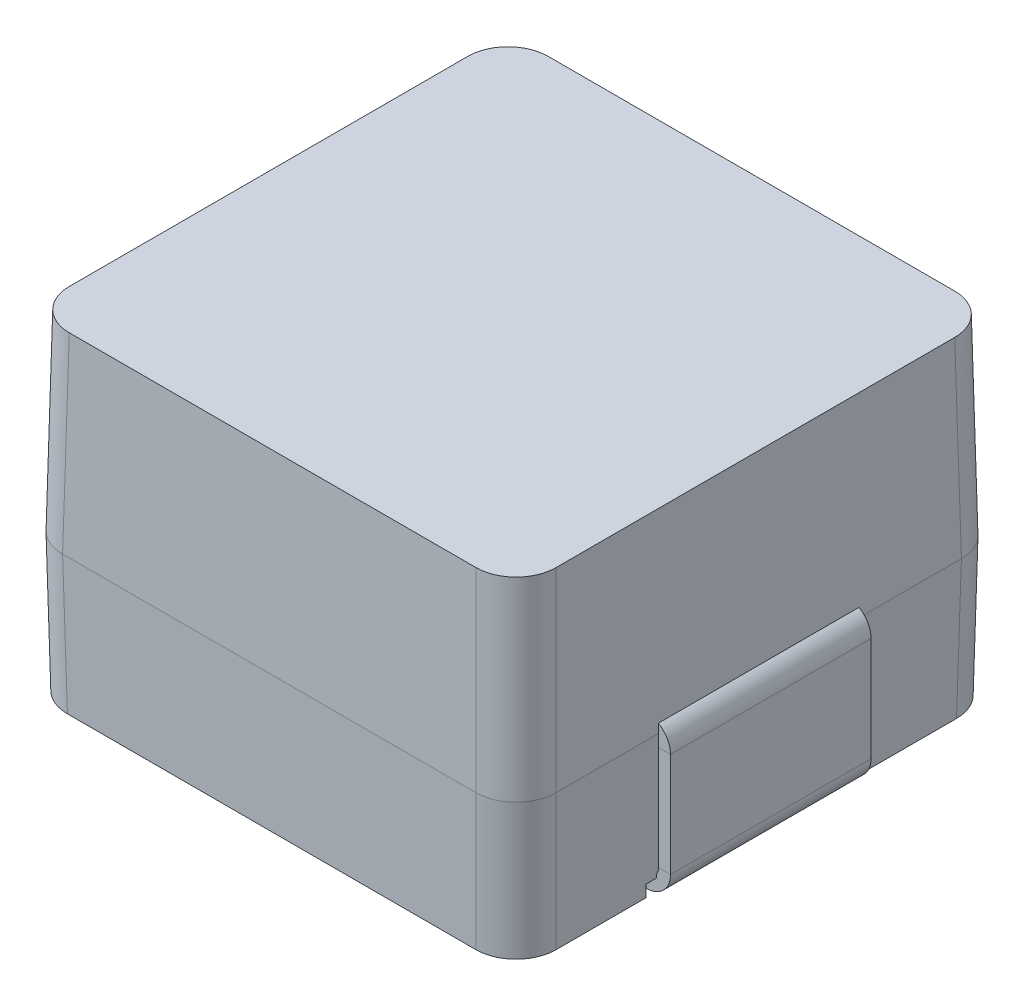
ISO-10303-21;
HEADER;
FILE_DESCRIPTION(('STEP AP214'),'2;1');
FILE_NAME('part.step','',(''),(''),'','','');
FILE_SCHEMA(('AUTOMOTIVE_DESIGN { 1 0 10303 214 1 1 1 1 }'));
ENDSEC;
DATA;
#1=APPLICATION_CONTEXT('core data for automotive mechanical design processes');
#2=APPLICATION_PROTOCOL_DEFINITION('international standard','automotive_design',2000,#1);
#3=PRODUCT_CONTEXT('',#1,'mechanical');
#4=PRODUCT('Part','Part','',(#3));
#5=PRODUCT_RELATED_PRODUCT_CATEGORY('part','',(#4));
#6=PRODUCT_DEFINITION_FORMATION('','',#4);
#7=PRODUCT_DEFINITION_CONTEXT('part definition',#1,'design');
#8=PRODUCT_DEFINITION('design','',#6,#7);
#9=PRODUCT_DEFINITION_SHAPE('','',#8);
#10=(LENGTH_UNIT() NAMED_UNIT(*) SI_UNIT(.MILLI.,.METRE.));
#11=(NAMED_UNIT(*) PLANE_ANGLE_UNIT() SI_UNIT($,.RADIAN.));
#12=(NAMED_UNIT(*) SI_UNIT($,.STERADIAN.) SOLID_ANGLE_UNIT());
#13=UNCERTAINTY_MEASURE_WITH_UNIT(LENGTH_MEASURE(1.E-05),#10,'distance_accuracy_value','');
#14=(GEOMETRIC_REPRESENTATION_CONTEXT(3) GLOBAL_UNCERTAINTY_ASSIGNED_CONTEXT((#13)) GLOBAL_UNIT_ASSIGNED_CONTEXT((#10,
#11,#12)) REPRESENTATION_CONTEXT('',''));
#15=CARTESIAN_POINT('',(0.,0.,0.));
#16=DIRECTION('',(0.,0.,1.));
#17=DIRECTION('',(1.,0.,0.));
#18=AXIS2_PLACEMENT_3D('',#15,#16,#17);
#19=CARTESIAN_POINT('',(-78.8312868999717,23.2984329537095,29.348950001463));
#20=DIRECTION('',(1.,0.,0.));
#21=DIRECTION('',(0.,0.,1.));
#22=AXIS2_PLACEMENT_3D('',#19,#20,#21);
#23=PLANE('',#22);
#24=DIRECTION('',(0.,-1.,0.));
#25=VECTOR('',#24,1.);
#26=CARTESIAN_POINT('',(-78.8312868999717,23.2984329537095,28.078950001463));
#27=LINE('',#26,#25);
#28=CARTESIAN_POINT('',(-78.8312868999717,18.6502329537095,28.078950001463));
#29=VERTEX_POINT('',#28);
#30=CARTESIAN_POINT('',(-78.8312868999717,19.9675489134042,28.078950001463));
#31=VERTEX_POINT('',#30);
#32=EDGE_CURVE('P0_E33',#29,#31,#27,.F.);
#33=ORIENTED_EDGE('',*,*,#32,.F.);
#34=DIRECTION('',(0.,0.,1.));
#35=VECTOR('',#34,1.);
#36=CARTESIAN_POINT('',(-78.8312868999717,18.6502329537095,29.348950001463));
#37=LINE('',#36,#35);
#38=CARTESIAN_POINT('',(-78.8312868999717,18.6502329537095,30.618950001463));
#39=VERTEX_POINT('',#38);
#40=EDGE_CURVE('P0_E25',#29,#39,#37,.T.);
#41=ORIENTED_EDGE('',*,*,#40,.T.);
#42=DIRECTION('',(0.,-1.,0.));
#43=VECTOR('',#42,1.);
#44=CARTESIAN_POINT('',(-78.8312868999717,23.2984329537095,30.618950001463));
#45=LINE('',#44,#43);
#46=CARTESIAN_POINT('',(-78.8312868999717,19.9675489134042,30.618950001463));
#47=VERTEX_POINT('',#46);
#48=EDGE_CURVE('P0_E41',#47,#39,#45,.T.);
#49=ORIENTED_EDGE('',*,*,#48,.F.);
#50=DIRECTION('',(0.,0.,-1.));
#51=VECTOR('',#50,1.);
#52=CARTESIAN_POINT('',(-78.8312868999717,19.9675489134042,29.348950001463));
#53=LINE('',#52,#51);
#54=EDGE_CURVE('P0_E252',#47,#31,#53,.T.);
#55=ORIENTED_EDGE('',*,*,#54,.T.);
#56=EDGE_LOOP('',(#33,#41,#49,#55));
#57=FACE_BOUND('',#56,.T.);
#58=ADVANCED_FACE('P0_F16',(#57),#23,.F.);
#59=CARTESIAN_POINT('',(-85.0796868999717,23.2984329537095,29.348950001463));
#60=DIRECTION('',(-1.,0.,0.));
#61=DIRECTION('',(0.,0.,1.));
#62=AXIS2_PLACEMENT_3D('',#59,#60,#61);
#63=PLANE('',#62);
#64=DIRECTION('',(0.,1.,0.));
#65=VECTOR('',#64,1.);
#66=CARTESIAN_POINT('',(-85.0796868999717,23.2984329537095,30.618950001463));
#67=LINE('',#66,#65);
#68=CARTESIAN_POINT('',(-85.0796868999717,18.6502329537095,30.618950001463));
#69=VERTEX_POINT('',#68);
#70=CARTESIAN_POINT('',(-85.0796868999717,19.9675489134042,30.618950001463));
#71=VERTEX_POINT('',#70);
#72=EDGE_CURVE('P0_E326',#69,#71,#67,.T.);
#73=ORIENTED_EDGE('',*,*,#72,.F.);
#74=DIRECTION('',(0.,0.,-1.));
#75=VECTOR('',#74,1.);
#76=CARTESIAN_POINT('',(-85.0796868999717,18.6502329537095,29.348950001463));
#77=LINE('',#76,#75);
#78=CARTESIAN_POINT('',(-85.0796868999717,18.6502329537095,28.078950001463));
#79=VERTEX_POINT('',#78);
#80=EDGE_CURVE('P0_E338',#69,#79,#77,.T.);
#81=ORIENTED_EDGE('',*,*,#80,.T.);
#82=DIRECTION('',(0.,1.,0.));
#83=VECTOR('',#82,1.);
#84=CARTESIAN_POINT('',(-85.0796868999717,23.2984329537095,28.078950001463));
#85=LINE('',#84,#83);
#86=CARTESIAN_POINT('',(-85.0796868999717,19.9675489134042,28.078950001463));
#87=VERTEX_POINT('',#86);
#88=EDGE_CURVE('P0_E346',#87,#79,#85,.F.);
#89=ORIENTED_EDGE('',*,*,#88,.F.);
#90=DIRECTION('',(0.,0.,-1.));
#91=VECTOR('',#90,1.);
#92=CARTESIAN_POINT('',(-85.0796868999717,19.9675489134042,29.348950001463));
#93=LINE('',#92,#91);
#94=EDGE_CURVE('P0_E308',#71,#87,#93,.T.);
#95=ORIENTED_EDGE('',*,*,#94,.F.);
#96=EDGE_LOOP('',(#73,#81,#89,#95));
#97=FACE_BOUND('',#96,.T.);
#98=ADVANCED_FACE('P0_F420',(#97),#63,.F.);
#99=CARTESIAN_POINT('',(-76.2404868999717,20.2723489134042,28.078950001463));
#100=DIRECTION('',(0.,0.,-1.));
#101=DIRECTION('',(-1.,0.,0.));
#102=AXIS2_PLACEMENT_3D('',#99,#100,#101);
#103=PLANE('',#102);
#104=DIRECTION('',(-1.,0.,0.));
#105=VECTOR('',#104,1.);
#106=CARTESIAN_POINT('',(-76.2404868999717,20.2723489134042,28.078950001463));
#107=LINE('',#106,#105);
#108=CARTESIAN_POINT('',(-78.9836868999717,20.2723489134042,28.078950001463));
#109=VERTEX_POINT('',#108);
#110=CARTESIAN_POINT('',(-84.9272868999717,20.2723489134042,28.078950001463));
#111=VERTEX_POINT('',#110);
#112=EDGE_CURVE('P0_E329',#109,#111,#107,.T.);
#113=ORIENTED_EDGE('',*,*,#112,.F.);
#114=DIRECTION('',(0.,-1.,0.));
#115=VECTOR('',#114,1.);
#116=CARTESIAN_POINT('',(-78.9836868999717,20.2723489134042,28.078950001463));
#117=LINE('',#116,#115);
#118=CARTESIAN_POINT('',(-78.9836868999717,20.1199489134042,28.078950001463));
#119=VERTEX_POINT('',#118);
#120=EDGE_CURVE('P0_E321',#109,#119,#117,.T.);
#121=ORIENTED_EDGE('',*,*,#120,.T.);
#122=DIRECTION('',(1.,0.,0.));
#123=VECTOR('',#122,1.);
#124=CARTESIAN_POINT('',(-81.9554868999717,20.1199489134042,28.078950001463));
#125=LINE('',#124,#123);
#126=CARTESIAN_POINT('',(-84.9272868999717,20.1199489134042,28.078950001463));
#127=VERTEX_POINT('',#126);
#128=EDGE_CURVE('P0_E290',#119,#127,#125,.F.);
#129=ORIENTED_EDGE('',*,*,#128,.T.);
#130=DIRECTION('',(0.,-1.,0.));
#131=VECTOR('',#130,1.);
#132=CARTESIAN_POINT('',(-84.9272868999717,20.2723489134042,28.078950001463));
#133=LINE('',#132,#131);
#134=EDGE_CURVE('P0_E296',#111,#127,#133,.T.);
#135=ORIENTED_EDGE('',*,*,#134,.F.);
#136=EDGE_LOOP('',(#113,#121,#129,#135));
#137=FACE_BOUND('',#136,.T.);
#138=ADVANCED_FACE('P0_F374',(#137),#103,.T.);
#139=CARTESIAN_POINT('',(-76.2404868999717,20.2723489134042,30.618950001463));
#140=DIRECTION('',(0.,0.,1.));
#141=DIRECTION('',(1.,0.,0.));
#142=AXIS2_PLACEMENT_3D('',#139,#140,#141);
#143=PLANE('',#142);
#144=DIRECTION('',(1.,0.,0.));
#145=VECTOR('',#144,1.);
#146=CARTESIAN_POINT('',(-81.9554868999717,20.1199489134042,30.618950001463));
#147=LINE('',#146,#145);
#148=CARTESIAN_POINT('',(-84.9272868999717,20.1199489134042,30.618950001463));
#149=VERTEX_POINT('',#148);
#150=CARTESIAN_POINT('',(-78.9836868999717,20.1199489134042,30.618950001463));
#151=VERTEX_POINT('',#150);
#152=EDGE_CURVE('P0_E291',#149,#151,#147,.T.);
#153=ORIENTED_EDGE('',*,*,#152,.T.);
#154=DIRECTION('',(0.,1.,0.));
#155=VECTOR('',#154,1.);
#156=CARTESIAN_POINT('',(-78.9836868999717,20.2723489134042,30.618950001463));
#157=LINE('',#156,#155);
#158=CARTESIAN_POINT('',(-78.9836868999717,20.2723489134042,30.618950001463));
#159=VERTEX_POINT('',#158);
#160=EDGE_CURVE('P0_E316',#151,#159,#157,.T.);
#161=ORIENTED_EDGE('',*,*,#160,.T.);
#162=DIRECTION('',(1.,0.,0.));
#163=VECTOR('',#162,1.);
#164=CARTESIAN_POINT('',(-76.2404868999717,20.2723489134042,30.618950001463));
#165=LINE('',#164,#163);
#166=CARTESIAN_POINT('',(-84.9272868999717,20.2723489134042,30.618950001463));
#167=VERTEX_POINT('',#166);
#168=EDGE_CURVE('P0_E295',#167,#159,#165,.T.);
#169=ORIENTED_EDGE('',*,*,#168,.F.);
#170=DIRECTION('',(0.,1.,0.));
#171=VECTOR('',#170,1.);
#172=CARTESIAN_POINT('',(-84.9272868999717,20.2723489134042,30.618950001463));
#173=LINE('',#172,#171);
#174=EDGE_CURVE('P0_E292',#149,#167,#173,.T.);
#175=ORIENTED_EDGE('',*,*,#174,.F.);
#176=EDGE_LOOP('',(#153,#161,#169,#175));
#177=FACE_BOUND('',#176,.T.);
#178=ADVANCED_FACE('P0_F381',(#177),#143,.T.);
#179=CARTESIAN_POINT('',(-81.9554868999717,20.2723489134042,29.348950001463));
#180=DIRECTION('',(0.,1.,0.));
#181=DIRECTION('',(0.,0.,1.));
#182=AXIS2_PLACEMENT_3D('',#179,#180,#181);
#183=PLANE('',#182);
#184=ORIENTED_EDGE('',*,*,#168,.T.);
#185=DIRECTION('',(0.,0.,-1.));
#186=VECTOR('',#185,1.);
#187=CARTESIAN_POINT('',(-78.9836868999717,20.2723489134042,29.348950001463));
#188=LINE('',#187,#186);
#189=EDGE_CURVE('P0_E313',#159,#109,#188,.T.);
#190=ORIENTED_EDGE('',*,*,#189,.T.);
#191=ORIENTED_EDGE('',*,*,#112,.T.);
#192=DIRECTION('',(0.,0.,-1.));
#193=VECTOR('',#192,1.);
#194=CARTESIAN_POINT('',(-84.9272868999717,20.2723489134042,29.348950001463));
#195=LINE('',#194,#193);
#196=EDGE_CURVE('P0_E282',#167,#111,#195,.T.);
#197=ORIENTED_EDGE('',*,*,#196,.F.);
#198=EDGE_LOOP('',(#184,#190,#191,#197));
#199=FACE_BOUND('',#198,.T.);
#200=ADVANCED_FACE('P0_F378',(#199),#183,.T.);
#201=CARTESIAN_POINT('',(-85.2320868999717,29.0134329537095,28.078950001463));
#202=DIRECTION('',(0.,0.,-1.));
#203=DIRECTION('',(0.,-1.,0.));
#204=AXIS2_PLACEMENT_3D('',#201,#202,#203);
#205=PLANE('',#204);
#206=DIRECTION('',(1.,0.,0.));
#207=VECTOR('',#206,1.);
#208=CARTESIAN_POINT('',(-85.2320868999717,18.6502329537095,28.078950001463));
#209=LINE('',#208,#207);
#210=CARTESIAN_POINT('',(-85.2320868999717,18.6502329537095,28.078950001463));
#211=VERTEX_POINT('',#210);
#212=EDGE_CURVE('P0_E335',#211,#79,#209,.T.);
#213=ORIENTED_EDGE('',*,*,#212,.F.);
#214=DIRECTION('',(0.,-1.,0.));
#215=VECTOR('',#214,1.);
#216=CARTESIAN_POINT('',(-85.2320868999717,29.0134329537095,28.078950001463));
#217=LINE('',#216,#215);
#218=CARTESIAN_POINT('',(-85.2320868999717,19.9675489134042,28.078950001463));
#219=VERTEX_POINT('',#218);
#220=EDGE_CURVE('P0_E305',#219,#211,#217,.T.);
#221=ORIENTED_EDGE('',*,*,#220,.F.);
#222=DIRECTION('',(1.,0.,0.));
#223=VECTOR('',#222,1.);
#224=CARTESIAN_POINT('',(-85.2320868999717,19.9675489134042,28.078950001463));
#225=LINE('',#224,#223);
#226=EDGE_CURVE('P0_E310',#219,#87,#225,.T.);
#227=ORIENTED_EDGE('',*,*,#226,.T.);
#228=ORIENTED_EDGE('',*,*,#88,.T.);
#229=EDGE_LOOP('',(#213,#221,#227,#228));
#230=FACE_BOUND('',#229,.T.);
#231=ADVANCED_FACE('P0_F434',(#230),#205,.T.);
#232=CARTESIAN_POINT('',(-85.2320868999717,29.0134329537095,30.618950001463));
#233=DIRECTION('',(0.,0.,1.));
#234=DIRECTION('',(0.,1.,0.));
#235=AXIS2_PLACEMENT_3D('',#232,#233,#234);
#236=PLANE('',#235);
#237=DIRECTION('',(-1.,0.,0.));
#238=VECTOR('',#237,1.);
#239=CARTESIAN_POINT('',(-85.2320868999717,18.6502329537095,30.618950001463));
#240=LINE('',#239,#238);
#241=CARTESIAN_POINT('',(-85.2320868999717,18.6502329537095,30.618950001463));
#242=VERTEX_POINT('',#241);
#243=EDGE_CURVE('P0_E341',#69,#242,#240,.T.);
#244=ORIENTED_EDGE('',*,*,#243,.F.);
#245=ORIENTED_EDGE('',*,*,#72,.T.);
#246=DIRECTION('',(-1.,0.,0.));
#247=VECTOR('',#246,1.);
#248=CARTESIAN_POINT('',(-85.2320868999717,19.9675489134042,30.618950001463));
#249=LINE('',#248,#247);
#250=CARTESIAN_POINT('',(-85.2320868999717,19.9675489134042,30.618950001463));
#251=VERTEX_POINT('',#250);
#252=EDGE_CURVE('P0_E304',#71,#251,#249,.T.);
#253=ORIENTED_EDGE('',*,*,#252,.T.);
#254=DIRECTION('',(0.,1.,0.));
#255=VECTOR('',#254,1.);
#256=CARTESIAN_POINT('',(-85.2320868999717,29.0134329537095,30.618950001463));
#257=LINE('',#256,#255);
#258=EDGE_CURVE('P0_E348',#242,#251,#257,.T.);
#259=ORIENTED_EDGE('',*,*,#258,.F.);
#260=EDGE_LOOP('',(#244,#245,#253,#259));
#261=FACE_BOUND('',#260,.T.);
#262=ADVANCED_FACE('P0_F431',(#261),#236,.T.);
#263=CARTESIAN_POINT('',(-85.2320868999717,23.2984329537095,29.348950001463));
#264=DIRECTION('',(-1.,0.,0.));
#265=DIRECTION('',(0.,0.,1.));
#266=AXIS2_PLACEMENT_3D('',#263,#264,#265);
#267=PLANE('',#266);
#268=DIRECTION('',(0.,0.,-1.));
#269=VECTOR('',#268,1.);
#270=CARTESIAN_POINT('',(-85.2320868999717,18.6502329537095,29.348950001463));
#271=LINE('',#270,#269);
#272=EDGE_CURVE('P0_E324',#242,#211,#271,.T.);
#273=ORIENTED_EDGE('',*,*,#272,.F.);
#274=ORIENTED_EDGE('',*,*,#258,.T.);
#275=DIRECTION('',(0.,0.,-1.));
#276=VECTOR('',#275,1.);
#277=CARTESIAN_POINT('',(-85.2320868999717,19.9675489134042,29.348950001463));
#278=LINE('',#277,#276);
#279=EDGE_CURVE('P0_E301',#251,#219,#278,.T.);
#280=ORIENTED_EDGE('',*,*,#279,.T.);
#281=ORIENTED_EDGE('',*,*,#220,.T.);
#282=EDGE_LOOP('',(#273,#274,#280,#281));
#283=FACE_BOUND('',#282,.T.);
#284=ADVANCED_FACE('P0_F433',(#283),#267,.T.);
#285=CARTESIAN_POINT('',(-81.9554868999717,20.1199489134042,29.348950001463));
#286=DIRECTION('',(0.,1.,0.));
#287=DIRECTION('',(0.,0.,1.));
#288=AXIS2_PLACEMENT_3D('',#285,#286,#287);
#289=PLANE('',#288);
#290=DIRECTION('',(0.,0.,-1.));
#291=VECTOR('',#290,1.);
#292=CARTESIAN_POINT('',(-78.9836868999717,20.1199489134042,29.348950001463));
#293=LINE('',#292,#291);
#294=EDGE_CURVE('P0_E319',#151,#119,#293,.T.);
#295=ORIENTED_EDGE('',*,*,#294,.F.);
#296=ORIENTED_EDGE('',*,*,#152,.F.);
#297=DIRECTION('',(0.,0.,-1.));
#298=VECTOR('',#297,1.);
#299=CARTESIAN_POINT('',(-84.9272868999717,20.1199489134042,29.348950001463));
#300=LINE('',#299,#298);
#301=EDGE_CURVE('P0_E287',#149,#127,#300,.T.);
#302=ORIENTED_EDGE('',*,*,#301,.T.);
#303=ORIENTED_EDGE('',*,*,#128,.F.);
#304=EDGE_LOOP('',(#295,#296,#302,#303));
#305=FACE_BOUND('',#304,.T.);
#306=ADVANCED_FACE('P0_F442',(#305),#289,.F.);
#307=CARTESIAN_POINT('',(-84.9272868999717,19.9675489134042,30.618950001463));
#308=DIRECTION('',(0.,0.,1.));
#309=DIRECTION('',(1.,0.,0.));
#310=AXIS2_PLACEMENT_3D('',#307,#308,#309);
#311=PLANE('',#310);
#312=ORIENTED_EDGE('',*,*,#252,.F.);
#313=CARTESIAN_POINT('',(-84.9272868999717,19.9675489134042,30.618950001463));
#314=DIRECTION('',(0.,0.,1.));
#315=DIRECTION('',(1.,0.,0.));
#316=AXIS2_PLACEMENT_3D('',#313,#314,#315);
#317=CIRCLE('',#316,0.1524);
#318=EDGE_CURVE('P0_E270',#71,#149,#317,.F.);
#319=ORIENTED_EDGE('',*,*,#318,.T.);
#320=ORIENTED_EDGE('',*,*,#174,.T.);
#321=CARTESIAN_POINT('',(-84.9272868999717,19.9675489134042,30.618950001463));
#322=DIRECTION('',(0.,0.,-1.));
#323=DIRECTION('',(-1.,0.,0.));
#324=AXIS2_PLACEMENT_3D('',#321,#322,#323);
#325=CIRCLE('',#324,0.3048);
#326=EDGE_CURVE('P0_E276',#251,#167,#325,.T.);
#327=ORIENTED_EDGE('',*,*,#326,.F.);
#328=EDGE_LOOP('',(#312,#319,#320,#327));
#329=FACE_BOUND('',#328,.T.);
#330=ADVANCED_FACE('P0_F448',(#329),#311,.T.);
#331=CARTESIAN_POINT('',(-84.9272868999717,19.9675489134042,28.078950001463));
#332=DIRECTION('',(0.,0.,-1.));
#333=DIRECTION('',(-1.,0.,0.));
#334=AXIS2_PLACEMENT_3D('',#331,#332,#333);
#335=PLANE('',#334);
#336=CARTESIAN_POINT('',(-84.9272868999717,19.9675489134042,28.078950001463));
#337=DIRECTION('',(0.,0.,1.));
#338=DIRECTION('',(1.,0.,0.));
#339=AXIS2_PLACEMENT_3D('',#336,#337,#338);
#340=CIRCLE('',#339,0.1524);
#341=EDGE_CURVE('P0_E280',#127,#87,#340,.T.);
#342=ORIENTED_EDGE('',*,*,#341,.T.);
#343=ORIENTED_EDGE('',*,*,#226,.F.);
#344=CARTESIAN_POINT('',(-84.9272868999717,19.9675489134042,28.078950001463));
#345=DIRECTION('',(0.,0.,1.));
#346=DIRECTION('',(1.,0.,0.));
#347=AXIS2_PLACEMENT_3D('',#344,#345,#346);
#348=CIRCLE('',#347,0.3048);
#349=EDGE_CURVE('P0_E279',#111,#219,#348,.T.);
#350=ORIENTED_EDGE('',*,*,#349,.F.);
#351=ORIENTED_EDGE('',*,*,#134,.T.);
#352=EDGE_LOOP('',(#342,#343,#350,#351));
#353=FACE_BOUND('',#352,.T.);
#354=ADVANCED_FACE('P0_F454',(#353),#335,.T.);
#355=CARTESIAN_POINT('',(-84.9272868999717,19.9675489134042,26.7791704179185));
#356=DIRECTION('',(0.,0.,1.));
#357=DIRECTION('',(1.,0.,0.));
#358=AXIS2_PLACEMENT_3D('',#355,#356,#357);
#359=CYLINDRICAL_SURFACE('',#358,0.3048);
#360=ORIENTED_EDGE('',*,*,#196,.T.);
#361=ORIENTED_EDGE('',*,*,#349,.T.);
#362=ORIENTED_EDGE('',*,*,#279,.F.);
#363=ORIENTED_EDGE('',*,*,#326,.T.);
#364=EDGE_LOOP('',(#360,#361,#362,#363));
#365=FACE_BOUND('',#364,.T.);
#366=ADVANCED_FACE('P0_F457',(#365),#359,.T.);
#367=CARTESIAN_POINT('',(-84.9272868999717,19.9675489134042,26.7791704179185));
#368=DIRECTION('',(0.,0.,1.));
#369=DIRECTION('',(1.,0.,0.));
#370=AXIS2_PLACEMENT_3D('',#367,#368,#369);
#371=CYLINDRICAL_SURFACE('',#370,0.1524);
#372=ORIENTED_EDGE('',*,*,#301,.F.);
#373=ORIENTED_EDGE('',*,*,#318,.F.);
#374=ORIENTED_EDGE('',*,*,#94,.T.);
#375=ORIENTED_EDGE('',*,*,#341,.F.);
#376=EDGE_LOOP('',(#372,#373,#374,#375));
#377=FACE_BOUND('',#376,.T.);
#378=ADVANCED_FACE('P0_F462',(#377),#371,.F.);
#379=CARTESIAN_POINT('',(-78.9836868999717,19.9675489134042,30.618950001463));
#380=DIRECTION('',(0.,0.,1.));
#381=DIRECTION('',(1.,0.,0.));
#382=AXIS2_PLACEMENT_3D('',#379,#380,#381);
#383=PLANE('',#382);
#384=ORIENTED_EDGE('',*,*,#160,.F.);
#385=CARTESIAN_POINT('',(-78.9836868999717,19.9675489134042,30.618950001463));
#386=DIRECTION('',(0.,0.,-1.));
#387=DIRECTION('',(-1.,0.,0.));
#388=AXIS2_PLACEMENT_3D('',#385,#386,#387);
#389=CIRCLE('',#388,0.1524);
#390=EDGE_CURVE('P0_E273',#151,#47,#389,.T.);
#391=ORIENTED_EDGE('',*,*,#390,.T.);
#392=DIRECTION('',(1.,0.,0.));
#393=VECTOR('',#392,1.);
#394=CARTESIAN_POINT('',(-78.6788868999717,19.9675489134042,30.618950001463));
#395=LINE('',#394,#393);
#396=CARTESIAN_POINT('',(-78.6788868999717,19.9675489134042,30.618950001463));
#397=VERTEX_POINT('',#396);
#398=EDGE_CURVE('P0_E254',#47,#397,#395,.T.);
#399=ORIENTED_EDGE('',*,*,#398,.T.);
#400=CARTESIAN_POINT('',(-78.9836868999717,19.9675489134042,30.618950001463));
#401=DIRECTION('',(0.,0.,-1.));
#402=DIRECTION('',(-1.,0.,0.));
#403=AXIS2_PLACEMENT_3D('',#400,#401,#402);
#404=CIRCLE('',#403,0.3048);
#405=EDGE_CURVE('P0_E263',#159,#397,#404,.T.);
#406=ORIENTED_EDGE('',*,*,#405,.F.);
#407=EDGE_LOOP('',(#384,#391,#399,#406));
#408=FACE_BOUND('',#407,.T.);
#409=ADVANCED_FACE('P0_F385',(#408),#383,.T.);
#410=CARTESIAN_POINT('',(-78.9836868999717,19.9675489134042,28.078950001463));
#411=DIRECTION('',(0.,0.,-1.));
#412=DIRECTION('',(-1.,0.,0.));
#413=AXIS2_PLACEMENT_3D('',#410,#411,#412);
#414=PLANE('',#413);
#415=DIRECTION('',(-1.,0.,0.));
#416=VECTOR('',#415,1.);
#417=CARTESIAN_POINT('',(-78.6788868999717,19.9675489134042,28.078950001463));
#418=LINE('',#417,#416);
#419=CARTESIAN_POINT('',(-78.6788868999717,19.9675489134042,28.078950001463));
#420=VERTEX_POINT('',#419);
#421=EDGE_CURVE('P0_E258',#420,#31,#418,.T.);
#422=ORIENTED_EDGE('',*,*,#421,.T.);
#423=CARTESIAN_POINT('',(-78.9836868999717,19.9675489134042,28.078950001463));
#424=DIRECTION('',(0.,0.,-1.));
#425=DIRECTION('',(-1.,0.,0.));
#426=AXIS2_PLACEMENT_3D('',#423,#424,#425);
#427=CIRCLE('',#426,0.1524);
#428=EDGE_CURVE('P0_E267',#31,#119,#427,.F.);
#429=ORIENTED_EDGE('',*,*,#428,.T.);
#430=ORIENTED_EDGE('',*,*,#120,.F.);
#431=CARTESIAN_POINT('',(-78.9836868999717,19.9675489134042,28.078950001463));
#432=DIRECTION('',(0.,0.,1.));
#433=DIRECTION('',(1.,0.,0.));
#434=AXIS2_PLACEMENT_3D('',#431,#432,#433);
#435=CIRCLE('',#434,0.3048);
#436=EDGE_CURVE('P0_E266',#420,#109,#435,.T.);
#437=ORIENTED_EDGE('',*,*,#436,.F.);
#438=EDGE_LOOP('',(#422,#429,#430,#437));
#439=FACE_BOUND('',#438,.T.);
#440=ADVANCED_FACE('P0_F370',(#439),#414,.T.);
#441=CARTESIAN_POINT('',(-78.9836868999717,19.9675489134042,31.9187295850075));
#442=DIRECTION('',(0.,0.,-1.));
#443=DIRECTION('',(-1.,0.,0.));
#444=AXIS2_PLACEMENT_3D('',#441,#442,#443);
#445=CYLINDRICAL_SURFACE('',#444,0.3048);
#446=ORIENTED_EDGE('',*,*,#436,.T.);
#447=ORIENTED_EDGE('',*,*,#189,.F.);
#448=ORIENTED_EDGE('',*,*,#405,.T.);
#449=DIRECTION('',(0.,0.,-1.));
#450=VECTOR('',#449,1.);
#451=CARTESIAN_POINT('',(-78.6788868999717,19.9675489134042,29.348950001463));
#452=LINE('',#451,#450);
#453=EDGE_CURVE('P0_E247',#397,#420,#452,.T.);
#454=ORIENTED_EDGE('',*,*,#453,.T.);
#455=EDGE_LOOP('',(#446,#447,#448,#454));
#456=FACE_BOUND('',#455,.T.);
#457=ADVANCED_FACE('P0_F368',(#456),#445,.T.);
#458=CARTESIAN_POINT('',(-78.9836868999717,19.9675489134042,31.9187295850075));
#459=DIRECTION('',(0.,0.,-1.));
#460=DIRECTION('',(-1.,0.,0.));
#461=AXIS2_PLACEMENT_3D('',#458,#459,#460);
#462=CYLINDRICAL_SURFACE('',#461,0.1524);
#463=ORIENTED_EDGE('',*,*,#428,.F.);
#464=ORIENTED_EDGE('',*,*,#54,.F.);
#465=ORIENTED_EDGE('',*,*,#390,.F.);
#466=ORIENTED_EDGE('',*,*,#294,.T.);
#467=EDGE_LOOP('',(#463,#464,#465,#466));
#468=FACE_BOUND('',#467,.T.);
#469=ADVANCED_FACE('P0_F388',(#468),#462,.F.);
#470=CARTESIAN_POINT('',(-78.6788868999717,23.2984329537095,29.348950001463));
#471=DIRECTION('',(1.,0.,0.));
#472=DIRECTION('',(0.,0.,1.));
#473=AXIS2_PLACEMENT_3D('',#470,#471,#472);
#474=PLANE('',#473);
#475=DIRECTION('',(0.,0.,1.));
#476=VECTOR('',#475,1.);
#477=CARTESIAN_POINT('',(-78.6788868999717,18.6502329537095,29.348950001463));
#478=LINE('',#477,#476);
#479=CARTESIAN_POINT('',(-78.6788868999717,18.6502329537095,28.078950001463));
#480=VERTEX_POINT('',#479);
#481=CARTESIAN_POINT('',(-78.6788868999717,18.6502329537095,30.618950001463));
#482=VERTEX_POINT('',#481);
#483=EDGE_CURVE('P0_E344',#480,#482,#478,.T.);
#484=ORIENTED_EDGE('',*,*,#483,.F.);
#485=DIRECTION('',(0.,1.,0.));
#486=VECTOR('',#485,1.);
#487=CARTESIAN_POINT('',(-78.6788868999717,17.5834329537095,28.078950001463));
#488=LINE('',#487,#486);
#489=EDGE_CURVE('P0_E20',#480,#420,#488,.T.);
#490=ORIENTED_EDGE('',*,*,#489,.T.);
#491=ORIENTED_EDGE('',*,*,#453,.F.);
#492=DIRECTION('',(0.,-1.,0.));
#493=VECTOR('',#492,1.);
#494=CARTESIAN_POINT('',(-78.6788868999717,17.5834329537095,30.618950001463));
#495=LINE('',#494,#493);
#496=EDGE_CURVE('P0_E257',#397,#482,#495,.T.);
#497=ORIENTED_EDGE('',*,*,#496,.T.);
#498=EDGE_LOOP('',(#484,#490,#491,#497));
#499=FACE_BOUND('',#498,.T.);
#500=ADVANCED_FACE('P0_F362',(#499),#474,.T.);
#501=CARTESIAN_POINT('',(-78.6788868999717,17.5834329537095,30.618950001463));
#502=DIRECTION('',(0.,0.,1.));
#503=DIRECTION('',(0.,-1.,0.));
#504=AXIS2_PLACEMENT_3D('',#501,#502,#503);
#505=PLANE('',#504);
#506=DIRECTION('',(-1.,0.,0.));
#507=VECTOR('',#506,1.);
#508=CARTESIAN_POINT('',(-78.6788868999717,18.6502329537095,30.618950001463));
#509=LINE('',#508,#507);
#510=EDGE_CURVE('P0_E353',#482,#39,#509,.T.);
#511=ORIENTED_EDGE('',*,*,#510,.F.);
#512=ORIENTED_EDGE('',*,*,#496,.F.);
#513=ORIENTED_EDGE('',*,*,#398,.F.);
#514=ORIENTED_EDGE('',*,*,#48,.T.);
#515=EDGE_LOOP('',(#511,#512,#513,#514));
#516=FACE_BOUND('',#515,.T.);
#517=ADVANCED_FACE('P0_F390',(#516),#505,.T.);
#518=CARTESIAN_POINT('',(-78.6788868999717,17.5834329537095,28.078950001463));
#519=DIRECTION('',(0.,0.,-1.));
#520=DIRECTION('',(0.,1.,0.));
#521=AXIS2_PLACEMENT_3D('',#518,#519,#520);
#522=PLANE('',#521);
#523=DIRECTION('',(1.,0.,0.));
#524=VECTOR('',#523,1.);
#525=CARTESIAN_POINT('',(-78.6788868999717,18.6502329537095,28.078950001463));
#526=LINE('',#525,#524);
#527=EDGE_CURVE('P0_E10',#29,#480,#526,.T.);
#528=ORIENTED_EDGE('',*,*,#527,.F.);
#529=ORIENTED_EDGE('',*,*,#32,.T.);
#530=ORIENTED_EDGE('',*,*,#421,.F.);
#531=ORIENTED_EDGE('',*,*,#489,.F.);
#532=EDGE_LOOP('',(#528,#529,#530,#531));
#533=FACE_BOUND('',#532,.T.);
#534=ADVANCED_FACE('P0_F18',(#533),#522,.T.);
#535=CARTESIAN_POINT('',(-84.9272868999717,18.6502329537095,30.618950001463));
#536=DIRECTION('',(0.,0.,1.));
#537=DIRECTION('',(1.,0.,0.));
#538=AXIS2_PLACEMENT_3D('',#535,#536,#537);
#539=PLANE('',#538);
#540=DIRECTION('',(0.,-1.,0.));
#541=VECTOR('',#540,1.);
#542=CARTESIAN_POINT('',(-84.9272868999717,18.3454329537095,30.618950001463));
#543=LINE('',#542,#541);
#544=CARTESIAN_POINT('',(-84.9272868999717,18.4978329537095,30.618950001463));
#545=VERTEX_POINT('',#544);
#546=CARTESIAN_POINT('',(-84.9272868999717,18.3454329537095,30.618950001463));
#547=VERTEX_POINT('',#546);
#548=EDGE_CURVE('P0_E210',#545,#547,#543,.T.);
#549=ORIENTED_EDGE('',*,*,#548,.F.);
#550=CARTESIAN_POINT('',(-84.9272868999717,18.6502329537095,30.618950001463));
#551=DIRECTION('',(0.,0.,1.));
#552=DIRECTION('',(1.,0.,0.));
#553=AXIS2_PLACEMENT_3D('',#550,#551,#552);
#554=CIRCLE('',#553,0.1524);
#555=EDGE_CURVE('P0_E212',#545,#69,#554,.F.);
#556=ORIENTED_EDGE('',*,*,#555,.T.);
#557=ORIENTED_EDGE('',*,*,#243,.T.);
#558=CARTESIAN_POINT('',(-84.9272868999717,18.6502329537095,30.618950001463));
#559=DIRECTION('',(0.,0.,-1.));
#560=DIRECTION('',(-1.,0.,0.));
#561=AXIS2_PLACEMENT_3D('',#558,#559,#560);
#562=CIRCLE('',#561,0.3048);
#563=EDGE_CURVE('P0_E240',#547,#242,#562,.T.);
#564=ORIENTED_EDGE('',*,*,#563,.F.);
#565=EDGE_LOOP('',(#549,#556,#557,#564));
#566=FACE_BOUND('',#565,.T.);
#567=ADVANCED_FACE('P0_F481',(#566),#539,.T.);
#568=CARTESIAN_POINT('',(-84.9272868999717,18.6502329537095,28.078950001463));
#569=DIRECTION('',(0.,0.,-1.));
#570=DIRECTION('',(-1.,0.,0.));
#571=AXIS2_PLACEMENT_3D('',#568,#569,#570);
#572=PLANE('',#571);
#573=CARTESIAN_POINT('',(-84.9272868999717,18.6502329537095,28.078950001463));
#574=DIRECTION('',(0.,0.,1.));
#575=DIRECTION('',(1.,0.,0.));
#576=AXIS2_PLACEMENT_3D('',#573,#574,#575);
#577=CIRCLE('',#576,0.1524);
#578=CARTESIAN_POINT('',(-84.9272868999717,18.4978329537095,28.078950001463));
#579=VERTEX_POINT('',#578);
#580=EDGE_CURVE('P0_E244',#79,#579,#577,.T.);
#581=ORIENTED_EDGE('',*,*,#580,.T.);
#582=DIRECTION('',(0.,1.,0.));
#583=VECTOR('',#582,1.);
#584=CARTESIAN_POINT('',(-84.9272868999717,18.3454329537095,28.078950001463));
#585=LINE('',#584,#583);
#586=CARTESIAN_POINT('',(-84.9272868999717,18.3454329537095,28.078950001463));
#587=VERTEX_POINT('',#586);
#588=EDGE_CURVE('P0_E220',#587,#579,#585,.T.);
#589=ORIENTED_EDGE('',*,*,#588,.F.);
#590=CARTESIAN_POINT('',(-84.9272868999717,18.6502329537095,28.078950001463));
#591=DIRECTION('',(0.,0.,1.));
#592=DIRECTION('',(1.,0.,0.));
#593=AXIS2_PLACEMENT_3D('',#590,#591,#592);
#594=CIRCLE('',#593,0.3048);
#595=EDGE_CURVE('P0_E243',#211,#587,#594,.T.);
#596=ORIENTED_EDGE('',*,*,#595,.F.);
#597=ORIENTED_EDGE('',*,*,#212,.T.);
#598=EDGE_LOOP('',(#581,#589,#596,#597));
#599=FACE_BOUND('',#598,.T.);
#600=ADVANCED_FACE('P0_F477',(#599),#572,.T.);
#601=CARTESIAN_POINT('',(-84.9272868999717,18.6502329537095,26.7791704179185));
#602=DIRECTION('',(0.,0.,1.));
#603=DIRECTION('',(1.,0.,0.));
#604=AXIS2_PLACEMENT_3D('',#601,#602,#603);
#605=CYLINDRICAL_SURFACE('',#604,0.3048);
#606=ORIENTED_EDGE('',*,*,#272,.T.);
#607=ORIENTED_EDGE('',*,*,#595,.T.);
#608=DIRECTION('',(0.,0.,-1.));
#609=VECTOR('',#608,1.);
#610=CARTESIAN_POINT('',(-84.9272868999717,18.3454329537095,29.348950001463));
#611=LINE('',#610,#609);
#612=EDGE_CURVE('P0_E228',#547,#587,#611,.T.);
#613=ORIENTED_EDGE('',*,*,#612,.F.);
#614=ORIENTED_EDGE('',*,*,#563,.T.);
#615=EDGE_LOOP('',(#606,#607,#613,#614));
#616=FACE_BOUND('',#615,.T.);
#617=ADVANCED_FACE('P0_F480',(#616),#605,.T.);
#618=CARTESIAN_POINT('',(-84.9272868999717,18.6502329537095,26.7791704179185));
#619=DIRECTION('',(0.,0.,1.));
#620=DIRECTION('',(1.,0.,0.));
#621=AXIS2_PLACEMENT_3D('',#618,#619,#620);
#622=CYLINDRICAL_SURFACE('',#621,0.1524);
#623=ORIENTED_EDGE('',*,*,#80,.F.);
#624=ORIENTED_EDGE('',*,*,#555,.F.);
#625=DIRECTION('',(0.,0.,-1.));
#626=VECTOR('',#625,1.);
#627=CARTESIAN_POINT('',(-84.9272868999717,18.4978329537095,29.348950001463));
#628=LINE('',#627,#626);
#629=EDGE_CURVE('P0_E205',#545,#579,#628,.T.);
#630=ORIENTED_EDGE('',*,*,#629,.T.);
#631=ORIENTED_EDGE('',*,*,#580,.F.);
#632=EDGE_LOOP('',(#623,#624,#630,#631));
#633=FACE_BOUND('',#632,.T.);
#634=ADVANCED_FACE('P0_F486',(#633),#622,.F.);
#635=CARTESIAN_POINT('',(-84.219570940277,18.3454329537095,30.618950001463));
#636=DIRECTION('',(1.,0.,0.));
#637=DIRECTION('',(0.,0.,1.));
#638=AXIS2_PLACEMENT_3D('',#635,#636,#637);
#639=PLANE('',#638);
#640=DIRECTION('',(0.,-1.,0.));
#641=VECTOR('',#640,1.);
#642=CARTESIAN_POINT('',(-84.219570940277,18.3454329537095,28.078950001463));
#643=LINE('',#642,#641);
#644=CARTESIAN_POINT('',(-84.219570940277,18.4978329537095,28.078950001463));
#645=VERTEX_POINT('',#644);
#646=CARTESIAN_POINT('',(-84.219570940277,18.3454329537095,28.078950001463));
#647=VERTEX_POINT('',#646);
#648=EDGE_CURVE('P0_E215',#645,#647,#643,.T.);
#649=ORIENTED_EDGE('',*,*,#648,.F.);
#650=DIRECTION('',(0.,0.,1.));
#651=VECTOR('',#650,1.);
#652=CARTESIAN_POINT('',(-84.219570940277,18.4978329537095,29.348950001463));
#653=LINE('',#652,#651);
#654=CARTESIAN_POINT('',(-84.219570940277,18.4978329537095,30.618950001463));
#655=VERTEX_POINT('',#654);
#656=EDGE_CURVE('P0_E235',#645,#655,#653,.T.);
#657=ORIENTED_EDGE('',*,*,#656,.T.);
#658=DIRECTION('',(0.,-1.,0.));
#659=VECTOR('',#658,1.);
#660=CARTESIAN_POINT('',(-84.219570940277,18.3454329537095,30.618950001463));
#661=LINE('',#660,#659);
#662=CARTESIAN_POINT('',(-84.219570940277,18.3454329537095,30.618950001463));
#663=VERTEX_POINT('',#662);
#664=EDGE_CURVE('P0_E233',#655,#663,#661,.T.);
#665=ORIENTED_EDGE('',*,*,#664,.T.);
#666=DIRECTION('',(0.,0.,1.));
#667=VECTOR('',#666,1.);
#668=CARTESIAN_POINT('',(-84.219570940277,18.3454329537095,30.618950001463));
#669=LINE('',#668,#667);
#670=EDGE_CURVE('P0_E223',#647,#663,#669,.T.);
#671=ORIENTED_EDGE('',*,*,#670,.F.);
#672=EDGE_LOOP('',(#649,#657,#665,#671));
#673=FACE_BOUND('',#672,.T.);
#674=ADVANCED_FACE('P0_F489',(#673),#639,.T.);
#675=CARTESIAN_POINT('',(-89.934570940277,18.3454329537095,29.348950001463));
#676=DIRECTION('',(0.,-1.,0.));
#677=DIRECTION('',(0.,0.,1.));
#678=AXIS2_PLACEMENT_3D('',#675,#676,#677);
#679=PLANE('',#678);
#680=DIRECTION('',(-1.,0.,0.));
#681=VECTOR('',#680,1.);
#682=CARTESIAN_POINT('',(-95.649570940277,18.3454329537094,30.618950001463));
#683=LINE('',#682,#681);
#684=EDGE_CURVE('P0_E230',#663,#547,#683,.T.);
#685=ORIENTED_EDGE('',*,*,#684,.T.);
#686=ORIENTED_EDGE('',*,*,#612,.T.);
#687=DIRECTION('',(1.,0.,0.));
#688=VECTOR('',#687,1.);
#689=CARTESIAN_POINT('',(-95.649570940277,18.3454329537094,28.078950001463));
#690=LINE('',#689,#688);
#691=EDGE_CURVE('P0_E226',#587,#647,#690,.T.);
#692=ORIENTED_EDGE('',*,*,#691,.T.);
#693=ORIENTED_EDGE('',*,*,#670,.T.);
#694=EDGE_LOOP('',(#685,#686,#692,#693));
#695=FACE_BOUND('',#694,.T.);
#696=ADVANCED_FACE('P0_F505',(#695),#679,.T.);
#697=CARTESIAN_POINT('',(-95.649570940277,18.3454329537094,28.078950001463));
#698=DIRECTION('',(0.,0.,-1.));
#699=DIRECTION('',(1.,0.,0.));
#700=AXIS2_PLACEMENT_3D('',#697,#698,#699);
#701=PLANE('',#700);
#702=ORIENTED_EDGE('',*,*,#691,.F.);
#703=ORIENTED_EDGE('',*,*,#588,.T.);
#704=DIRECTION('',(-1.,0.,0.));
#705=VECTOR('',#704,1.);
#706=CARTESIAN_POINT('',(-89.934570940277,18.4978329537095,28.078950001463));
#707=LINE('',#706,#705);
#708=EDGE_CURVE('P0_E218',#579,#645,#707,.F.);
#709=ORIENTED_EDGE('',*,*,#708,.T.);
#710=ORIENTED_EDGE('',*,*,#648,.T.);
#711=EDGE_LOOP('',(#702,#703,#709,#710));
#712=FACE_BOUND('',#711,.T.);
#713=ADVANCED_FACE('P0_F501',(#712),#701,.T.);
#714=CARTESIAN_POINT('',(-89.934570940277,18.4978329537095,29.348950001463));
#715=DIRECTION('',(0.,-1.,0.));
#716=DIRECTION('',(0.,0.,1.));
#717=AXIS2_PLACEMENT_3D('',#714,#715,#716);
#718=PLANE('',#717);
#719=ORIENTED_EDGE('',*,*,#629,.F.);
#720=DIRECTION('',(-1.,0.,0.));
#721=VECTOR('',#720,1.);
#722=CARTESIAN_POINT('',(-89.934570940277,18.4978329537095,30.618950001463));
#723=LINE('',#722,#721);
#724=EDGE_CURVE('P0_E213',#655,#545,#723,.T.);
#725=ORIENTED_EDGE('',*,*,#724,.F.);
#726=ORIENTED_EDGE('',*,*,#656,.F.);
#727=ORIENTED_EDGE('',*,*,#708,.F.);
#728=EDGE_LOOP('',(#719,#725,#726,#727));
#729=FACE_BOUND('',#728,.T.);
#730=ADVANCED_FACE('P0_F497',(#729),#718,.F.);
#731=CARTESIAN_POINT('',(-95.649570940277,18.3454329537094,30.618950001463));
#732=DIRECTION('',(0.,0.,1.));
#733=DIRECTION('',(-1.,0.,0.));
#734=AXIS2_PLACEMENT_3D('',#731,#732,#733);
#735=PLANE('',#734);
#736=ORIENTED_EDGE('',*,*,#724,.T.);
#737=ORIENTED_EDGE('',*,*,#548,.T.);
#738=ORIENTED_EDGE('',*,*,#684,.F.);
#739=ORIENTED_EDGE('',*,*,#664,.F.);
#740=EDGE_LOOP('',(#736,#737,#738,#739));
#741=FACE_BOUND('',#740,.T.);
#742=ADVANCED_FACE('P0_F494',(#741),#735,.T.);
#743=CARTESIAN_POINT('',(-78.9836868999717,18.6502329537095,28.078950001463));
#744=DIRECTION('',(0.,0.,-1.));
#745=DIRECTION('',(-1.,0.,0.));
#746=AXIS2_PLACEMENT_3D('',#743,#744,#745);
#747=PLANE('',#746);
#748=DIRECTION('',(0.,-1.,0.));
#749=VECTOR('',#748,1.);
#750=CARTESIAN_POINT('',(-78.9836868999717,18.3454329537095,28.078950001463));
#751=LINE('',#750,#749);
#752=CARTESIAN_POINT('',(-78.9836868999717,18.4978329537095,28.078950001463));
#753=VERTEX_POINT('',#752);
#754=CARTESIAN_POINT('',(-78.9836868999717,18.3454329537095,28.078950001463));
#755=VERTEX_POINT('',#754);
#756=EDGE_CURVE('P0_E179',#753,#755,#751,.T.);
#757=ORIENTED_EDGE('',*,*,#756,.F.);
#758=CARTESIAN_POINT('',(-78.9836868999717,18.6502329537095,28.078950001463));
#759=DIRECTION('',(0.,0.,-1.));
#760=DIRECTION('',(-1.,0.,0.));
#761=AXIS2_PLACEMENT_3D('',#758,#759,#760);
#762=CIRCLE('',#761,0.1524);
#763=EDGE_CURVE('P0_E181',#753,#29,#762,.F.);
#764=ORIENTED_EDGE('',*,*,#763,.T.);
#765=ORIENTED_EDGE('',*,*,#527,.T.);
#766=CARTESIAN_POINT('',(-78.9836868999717,18.6502329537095,28.078950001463));
#767=DIRECTION('',(0.,0.,1.));
#768=DIRECTION('',(1.,0.,0.));
#769=AXIS2_PLACEMENT_3D('',#766,#767,#768);
#770=CIRCLE('',#769,0.3048);
#771=EDGE_CURVE('P0_E198',#755,#480,#770,.T.);
#772=ORIENTED_EDGE('',*,*,#771,.F.);
#773=EDGE_LOOP('',(#757,#764,#765,#772));
#774=FACE_BOUND('',#773,.T.);
#775=ADVANCED_FACE('P0_F407',(#774),#747,.T.);
#776=CARTESIAN_POINT('',(-78.9836868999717,18.6502329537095,30.618950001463));
#777=DIRECTION('',(0.,0.,1.));
#778=DIRECTION('',(1.,0.,0.));
#779=AXIS2_PLACEMENT_3D('',#776,#777,#778);
#780=PLANE('',#779);
#781=CARTESIAN_POINT('',(-78.9836868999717,18.6502329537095,30.618950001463));
#782=DIRECTION('',(0.,0.,-1.));
#783=DIRECTION('',(-1.,0.,0.));
#784=AXIS2_PLACEMENT_3D('',#781,#782,#783);
#785=CIRCLE('',#784,0.1524);
#786=CARTESIAN_POINT('',(-78.9836868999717,18.4978329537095,30.618950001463));
#787=VERTEX_POINT('',#786);
#788=EDGE_CURVE('P0_E202',#39,#787,#785,.T.);
#789=ORIENTED_EDGE('',*,*,#788,.T.);
#790=DIRECTION('',(0.,1.,0.));
#791=VECTOR('',#790,1.);
#792=CARTESIAN_POINT('',(-78.9836868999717,18.3454329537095,30.618950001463));
#793=LINE('',#792,#791);
#794=CARTESIAN_POINT('',(-78.9836868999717,18.3454329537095,30.618950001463));
#795=VERTEX_POINT('',#794);
#796=EDGE_CURVE('P0_E187',#795,#787,#793,.T.);
#797=ORIENTED_EDGE('',*,*,#796,.F.);
#798=CARTESIAN_POINT('',(-78.9836868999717,18.6502329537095,30.618950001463));
#799=DIRECTION('',(0.,0.,-1.));
#800=DIRECTION('',(-1.,0.,0.));
#801=AXIS2_PLACEMENT_3D('',#798,#799,#800);
#802=CIRCLE('',#801,0.3048);
#803=EDGE_CURVE('P0_E201',#482,#795,#802,.T.);
#804=ORIENTED_EDGE('',*,*,#803,.F.);
#805=ORIENTED_EDGE('',*,*,#510,.T.);
#806=EDGE_LOOP('',(#789,#797,#804,#805));
#807=FACE_BOUND('',#806,.T.);
#808=ADVANCED_FACE('P0_F399',(#807),#780,.T.);
#809=CARTESIAN_POINT('',(-78.9836868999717,18.6502329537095,31.9187295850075));
#810=DIRECTION('',(0.,0.,-1.));
#811=DIRECTION('',(-1.,0.,0.));
#812=AXIS2_PLACEMENT_3D('',#809,#810,#811);
#813=CYLINDRICAL_SURFACE('',#812,0.3048);
#814=ORIENTED_EDGE('',*,*,#483,.T.);
#815=ORIENTED_EDGE('',*,*,#803,.T.);
#816=DIRECTION('',(0.,0.,1.));
#817=VECTOR('',#816,1.);
#818=CARTESIAN_POINT('',(-78.9836868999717,18.3454329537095,29.348950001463));
#819=LINE('',#818,#817);
#820=EDGE_CURVE('P0_E194',#755,#795,#819,.T.);
#821=ORIENTED_EDGE('',*,*,#820,.F.);
#822=ORIENTED_EDGE('',*,*,#771,.T.);
#823=EDGE_LOOP('',(#814,#815,#821,#822));
#824=FACE_BOUND('',#823,.T.);
#825=ADVANCED_FACE('P0_F395',(#824),#813,.T.);
#826=CARTESIAN_POINT('',(-78.9836868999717,18.6502329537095,31.9187295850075));
#827=DIRECTION('',(0.,0.,-1.));
#828=DIRECTION('',(-1.,0.,0.));
#829=AXIS2_PLACEMENT_3D('',#826,#827,#828);
#830=CYLINDRICAL_SURFACE('',#829,0.1524);
#831=ORIENTED_EDGE('',*,*,#40,.F.);
#832=ORIENTED_EDGE('',*,*,#763,.F.);
#833=DIRECTION('',(0.,0.,1.));
#834=VECTOR('',#833,1.);
#835=CARTESIAN_POINT('',(-78.9836868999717,18.4978329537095,29.348950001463));
#836=LINE('',#835,#834);
#837=EDGE_CURVE('P0_E174',#753,#787,#836,.T.);
#838=ORIENTED_EDGE('',*,*,#837,.T.);
#839=ORIENTED_EDGE('',*,*,#788,.F.);
#840=EDGE_LOOP('',(#831,#832,#838,#839));
#841=FACE_BOUND('',#840,.T.);
#842=ADVANCED_FACE('P0_F405',(#841),#830,.F.);
#843=CARTESIAN_POINT('',(-79.6914028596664,18.3454329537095,30.618950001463));
#844=DIRECTION('',(-1.,0.,0.));
#845=DIRECTION('',(0.,0.,-1.));
#846=AXIS2_PLACEMENT_3D('',#843,#844,#845);
#847=PLANE('',#846);
#848=DIRECTION('',(0.,-1.,0.));
#849=VECTOR('',#848,1.);
#850=CARTESIAN_POINT('',(-79.6914028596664,18.3454329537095,30.618950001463));
#851=LINE('',#850,#849);
#852=CARTESIAN_POINT('',(-79.6914028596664,18.4978329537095,30.618950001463));
#853=VERTEX_POINT('',#852);
#854=CARTESIAN_POINT('',(-79.6914028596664,18.3454329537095,30.618950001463));
#855=VERTEX_POINT('',#854);
#856=EDGE_CURVE('P0_E172',#853,#855,#851,.T.);
#857=ORIENTED_EDGE('',*,*,#856,.F.);
#858=DIRECTION('',(0.,0.,1.));
#859=VECTOR('',#858,1.);
#860=CARTESIAN_POINT('',(-79.6914028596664,18.4978329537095,29.348950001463));
#861=LINE('',#860,#859);
#862=CARTESIAN_POINT('',(-79.6914028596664,18.4978329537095,28.078950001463));
#863=VERTEX_POINT('',#862);
#864=EDGE_CURVE('P0_E166',#853,#863,#861,.F.);
#865=ORIENTED_EDGE('',*,*,#864,.T.);
#866=DIRECTION('',(0.,-1.,0.));
#867=VECTOR('',#866,1.);
#868=CARTESIAN_POINT('',(-79.6914028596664,18.3454329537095,28.078950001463));
#869=LINE('',#868,#867);
#870=CARTESIAN_POINT('',(-79.6914028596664,18.3454329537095,28.078950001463));
#871=VERTEX_POINT('',#870);
#872=EDGE_CURVE('P0_E155',#863,#871,#869,.T.);
#873=ORIENTED_EDGE('',*,*,#872,.T.);
#874=DIRECTION('',(0.,0.,-1.));
#875=VECTOR('',#874,1.);
#876=CARTESIAN_POINT('',(-79.6914028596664,18.3454329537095,30.618950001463));
#877=LINE('',#876,#875);
#878=EDGE_CURVE('P0_E190',#855,#871,#877,.T.);
#879=ORIENTED_EDGE('',*,*,#878,.F.);
#880=EDGE_LOOP('',(#857,#865,#873,#879));
#881=FACE_BOUND('',#880,.T.);
#882=ADVANCED_FACE('P0_F170',(#881),#847,.T.);
#883=CARTESIAN_POINT('',(-73.9764028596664,18.3454329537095,29.348950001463));
#884=DIRECTION('',(0.,-1.,0.));
#885=DIRECTION('',(0.,0.,1.));
#886=AXIS2_PLACEMENT_3D('',#883,#884,#885);
#887=PLANE('',#886);
#888=DIRECTION('',(1.,0.,0.));
#889=VECTOR('',#888,1.);
#890=CARTESIAN_POINT('',(-79.6914028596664,18.3454329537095,28.078950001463));
#891=LINE('',#890,#889);
#892=EDGE_CURVE('P0_E162',#871,#755,#891,.T.);
#893=ORIENTED_EDGE('',*,*,#892,.T.);
#894=ORIENTED_EDGE('',*,*,#820,.T.);
#895=DIRECTION('',(-1.,0.,0.));
#896=VECTOR('',#895,1.);
#897=CARTESIAN_POINT('',(-79.6914028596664,18.3454329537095,30.618950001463));
#898=LINE('',#897,#896);
#899=EDGE_CURVE('P0_E192',#795,#855,#898,.T.);
#900=ORIENTED_EDGE('',*,*,#899,.T.);
#901=ORIENTED_EDGE('',*,*,#878,.T.);
#902=EDGE_LOOP('',(#893,#894,#900,#901));
#903=FACE_BOUND('',#902,.T.);
#904=ADVANCED_FACE('P0_F409',(#903),#887,.T.);
#905=CARTESIAN_POINT('',(-79.6914028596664,18.3454329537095,30.618950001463));
#906=DIRECTION('',(0.,0.,1.));
#907=DIRECTION('',(-1.,0.,0.));
#908=AXIS2_PLACEMENT_3D('',#905,#906,#907);
#909=PLANE('',#908);
#910=ORIENTED_EDGE('',*,*,#899,.F.);
#911=ORIENTED_EDGE('',*,*,#796,.T.);
#912=DIRECTION('',(-1.,0.,0.));
#913=VECTOR('',#912,1.);
#914=CARTESIAN_POINT('',(-73.9764028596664,18.4978329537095,30.618950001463));
#915=LINE('',#914,#913);
#916=EDGE_CURVE('P0_E183',#787,#853,#915,.T.);
#917=ORIENTED_EDGE('',*,*,#916,.T.);
#918=ORIENTED_EDGE('',*,*,#856,.T.);
#919=EDGE_LOOP('',(#910,#911,#917,#918));
#920=FACE_BOUND('',#919,.T.);
#921=ADVANCED_FACE('P0_F402',(#920),#909,.T.);
#922=CARTESIAN_POINT('',(-73.9764028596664,18.4978329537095,29.348950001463));
#923=DIRECTION('',(0.,-1.,0.));
#924=DIRECTION('',(0.,0.,1.));
#925=AXIS2_PLACEMENT_3D('',#922,#923,#924);
#926=PLANE('',#925);
#927=ORIENTED_EDGE('',*,*,#837,.F.);
#928=DIRECTION('',(-1.,0.,0.));
#929=VECTOR('',#928,1.);
#930=CARTESIAN_POINT('',(-73.9764028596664,18.4978329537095,28.078950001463));
#931=LINE('',#930,#929);
#932=EDGE_CURVE('P0_E159',#863,#753,#931,.F.);
#933=ORIENTED_EDGE('',*,*,#932,.F.);
#934=ORIENTED_EDGE('',*,*,#864,.F.);
#935=ORIENTED_EDGE('',*,*,#916,.F.);
#936=EDGE_LOOP('',(#927,#933,#934,#935));
#937=FACE_BOUND('',#936,.T.);
#938=ADVANCED_FACE('P0_F176',(#937),#926,.F.);
#939=CARTESIAN_POINT('',(-79.6914028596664,18.3454329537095,28.078950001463));
#940=DIRECTION('',(0.,0.,-1.));
#941=DIRECTION('',(1.,0.,0.));
#942=AXIS2_PLACEMENT_3D('',#939,#940,#941);
#943=PLANE('',#942);
#944=ORIENTED_EDGE('',*,*,#932,.T.);
#945=ORIENTED_EDGE('',*,*,#756,.T.);
#946=ORIENTED_EDGE('',*,*,#892,.F.);
#947=ORIENTED_EDGE('',*,*,#872,.F.);
#948=EDGE_LOOP('',(#944,#945,#946,#947));
#949=FACE_BOUND('',#948,.T.);
#950=ADVANCED_FACE('P0_F157',(#949),#943,.T.);
#951=CLOSED_SHELL('',(#58,#98,#138,#178,#200,#231,#262,#284,#306,#330,#354,#366,#378,#409,#440,
#457,#469,#500,#517,#534,#567,#600,#617,#634,#674,#696,#713,#730,#742,#775,#808,#825,#842,#882,
#904,#921,#938,#950));
#952=MANIFOLD_SOLID_BREP('P0_B1',#951);
#953=CARTESIAN_POINT('',(-85.0796868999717,20.1199489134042,32.422350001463));
#954=DIRECTION('',(-0.999847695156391,-0.0174524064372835,0.));
#955=DIRECTION('',(0.0174524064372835,-0.999847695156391,0.));
#956=AXIS2_PLACEMENT_3D('',#953,#954,#955);
#957=PLANE('',#956);
#958=DIRECTION('',(0.,0.,1.));
#959=VECTOR('',#958,1.);
#960=CARTESIAN_POINT('',(-85.0490951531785,18.3673489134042,29.348950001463));
#961=LINE('',#960,#959);
#962=CARTESIAN_POINT('',(-85.0490951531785,18.3673489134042,30.745950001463));
#963=VERTEX_POINT('',#962);
#964=CARTESIAN_POINT('',(-85.0490951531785,18.3673489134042,31.8838356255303));
#965=VERTEX_POINT('',#964);
#966=EDGE_CURVE('P1_E285',#963,#965,#961,.T.);
#967=ORIENTED_EDGE('',*,*,#966,.T.);
#968=DIRECTION('',(-0.0174497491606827,0.999695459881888,0.0174497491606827));
#969=VECTOR('',#968,1.);
#970=CARTESIAN_POINT('',(-85.0798415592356,20.1288093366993,31.9145820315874));
#971=LINE('',#970,#969);
#972=CARTESIAN_POINT('',(-85.0796868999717,20.1199489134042,31.9144273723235));
#973=VERTEX_POINT('',#972);
#974=EDGE_CURVE('P1_E345',#965,#973,#971,.T.);
#975=ORIENTED_EDGE('',*,*,#974,.T.);
#976=DIRECTION('',(0.,0.,1.));
#977=VECTOR('',#976,1.);
#978=CARTESIAN_POINT('',(-85.0796868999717,20.1199489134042,32.422350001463));
#979=LINE('',#978,#977);
#980=CARTESIAN_POINT('',(-85.0796868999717,20.1199489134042,26.7834726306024));
#981=VERTEX_POINT('',#980);
#982=EDGE_CURVE('P1_E274',#981,#973,#979,.T.);
#983=ORIENTED_EDGE('',*,*,#982,.F.);
#984=DIRECTION('',(-0.0174497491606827,0.999695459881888,-0.0174497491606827));
#985=VECTOR('',#984,1.);
#986=CARTESIAN_POINT('',(-85.0779698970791,20.0215818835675,26.785189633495));
#987=LINE('',#986,#985);
#988=CARTESIAN_POINT('',(-85.0490951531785,18.3673489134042,26.8140643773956));
#989=VERTEX_POINT('',#988);
#990=EDGE_CURVE('P1_E343',#981,#989,#987,.F.);
#991=ORIENTED_EDGE('',*,*,#990,.T.);
#992=CARTESIAN_POINT('',(-85.0490951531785,18.3673489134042,27.951950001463));
#993=VERTEX_POINT('',#992);
#994=EDGE_CURVE('P1_E286',#989,#993,#961,.T.);
#995=ORIENTED_EDGE('',*,*,#994,.T.);
#996=DIRECTION('',(0.0174524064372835,-0.999847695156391,0.));
#997=VECTOR('',#996,1.);
#998=CARTESIAN_POINT('',(-85.0796868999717,20.1199489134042,27.951950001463));
#999=LINE('',#998,#997);
#1000=CARTESIAN_POINT('',(-85.0517553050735,18.5197489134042,27.951950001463));
#1001=VERTEX_POINT('',#1000);
#1002=EDGE_CURVE('P1_E270',#1001,#993,#999,.T.);
#1003=ORIENTED_EDGE('',*,*,#1002,.F.);
#1004=DIRECTION('',(0.,0.,1.));
#1005=VECTOR('',#1004,1.);
#1006=CARTESIAN_POINT('',(-85.0517553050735,18.5197489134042,32.422350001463));
#1007=LINE('',#1006,#1005);
#1008=CARTESIAN_POINT('',(-85.0517553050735,18.5197489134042,30.745950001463));
#1009=VERTEX_POINT('',#1008);
#1010=EDGE_CURVE('P1_E188',#1001,#1009,#1007,.T.);
#1011=ORIENTED_EDGE('',*,*,#1010,.T.);
#1012=DIRECTION('',(-0.0174524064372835,0.999847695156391,0.));
#1013=VECTOR('',#1012,1.);
#1014=CARTESIAN_POINT('',(-85.0796868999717,20.1199489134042,30.745950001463));
#1015=LINE('',#1014,#1013);
#1016=EDGE_CURVE('P1_E272',#963,#1009,#1015,.T.);
#1017=ORIENTED_EDGE('',*,*,#1016,.F.);
#1018=EDGE_LOOP('',(#967,#975,#983,#991,#995,#1003,#1011,#1017));
#1019=FACE_BOUND('',#1018,.T.);
#1020=ADVANCED_FACE('P1_F17',(#1019),#957,.T.);
#1021=CARTESIAN_POINT('',(-78.8312868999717,20.1199489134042,26.275550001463));
#1022=DIRECTION('',(0.,-0.0174524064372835,-0.999847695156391));
#1023=DIRECTION('',(0.,0.999847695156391,-0.0174524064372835));
#1024=AXIS2_PLACEMENT_3D('',#1021,#1022,#1023);
#1025=PLANE('',#1024);
#1026=DIRECTION('',(-1.,0.,0.));
#1027=VECTOR('',#1026,1.);
#1028=CARTESIAN_POINT('',(-81.9554868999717,18.3673489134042,26.3061417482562));
#1029=LINE('',#1028,#1027);
#1030=CARTESIAN_POINT('',(-79.3698012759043,18.3673489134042,26.3061417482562));
#1031=VERTEX_POINT('',#1030);
#1032=CARTESIAN_POINT('',(-84.541172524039,18.3673489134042,26.3061417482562));
#1033=VERTEX_POINT('',#1032);
#1034=EDGE_CURVE('P1_E289',#1031,#1033,#1029,.T.);
#1035=ORIENTED_EDGE('',*,*,#1034,.T.);
#1036=DIRECTION('',(-0.0174497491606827,0.999695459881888,-0.0174497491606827));
#1037=VECTOR('',#1036,1.);
#1038=CARTESIAN_POINT('',(-84.5700163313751,20.0198095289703,26.2772979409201));
#1039=LINE('',#1038,#1037);
#1040=CARTESIAN_POINT('',(-84.5717642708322,20.1199489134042,26.275550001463));
#1041=VERTEX_POINT('',#1040);
#1042=EDGE_CURVE('P1_E11',#1033,#1041,#1039,.T.);
#1043=ORIENTED_EDGE('',*,*,#1042,.T.);
#1044=DIRECTION('',(-1.,0.,0.));
#1045=VECTOR('',#1044,1.);
#1046=CARTESIAN_POINT('',(-78.8312868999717,20.1199489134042,26.275550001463));
#1047=LINE('',#1046,#1045);
#1048=CARTESIAN_POINT('',(-79.3392095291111,20.1199489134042,26.275550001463));
#1049=VERTEX_POINT('',#1048);
#1050=EDGE_CURVE('P1_E283',#1049,#1041,#1047,.T.);
#1051=ORIENTED_EDGE('',*,*,#1050,.F.);
#1052=DIRECTION('',(0.0174497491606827,0.999695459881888,-0.0174497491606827));
#1053=VECTOR('',#1052,1.);
#1054=CARTESIAN_POINT('',(-79.3390548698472,20.1288093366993,26.2753953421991));
#1055=LINE('',#1054,#1053);
#1056=EDGE_CURVE('P1_E26',#1049,#1031,#1055,.F.);
#1057=ORIENTED_EDGE('',*,*,#1056,.T.);
#1058=EDGE_LOOP('',(#1035,#1043,#1051,#1057));
#1059=FACE_BOUND('',#1058,.T.);
#1060=ADVANCED_FACE('P1_F417',(#1059),#1025,.T.);
#1061=CARTESIAN_POINT('',(-78.8312868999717,20.1199489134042,32.422350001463));
#1062=DIRECTION('',(0.999847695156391,-0.0174524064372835,0.));
#1063=DIRECTION('',(0.0174524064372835,0.999847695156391,0.));
#1064=AXIS2_PLACEMENT_3D('',#1061,#1062,#1063);
#1065=PLANE('',#1064);
#1066=DIRECTION('',(0.,0.,-1.));
#1067=VECTOR('',#1066,1.);
#1068=CARTESIAN_POINT('',(-78.8312868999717,20.1199489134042,32.422350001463));
#1069=LINE('',#1068,#1067);
#1070=CARTESIAN_POINT('',(-78.8312868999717,20.1199489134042,31.9144273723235));
#1071=VERTEX_POINT('',#1070);
#1072=CARTESIAN_POINT('',(-78.8312868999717,20.1199489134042,26.7834726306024));
#1073=VERTEX_POINT('',#1072);
#1074=EDGE_CURVE('P1_E280',#1071,#1073,#1069,.T.);
#1075=ORIENTED_EDGE('',*,*,#1074,.F.);
#1076=DIRECTION('',(0.0174497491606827,0.999695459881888,0.0174497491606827));
#1077=VECTOR('',#1076,1.);
#1078=CARTESIAN_POINT('',(-78.8311322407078,20.1288093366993,31.9145820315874));
#1079=LINE('',#1078,#1077);
#1080=CARTESIAN_POINT('',(-78.8618786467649,18.3673489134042,31.8838356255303));
#1081=VERTEX_POINT('',#1080);
#1082=EDGE_CURVE('P1_E328',#1071,#1081,#1079,.F.);
#1083=ORIENTED_EDGE('',*,*,#1082,.T.);
#1084=DIRECTION('',(0.,0.,-1.));
#1085=VECTOR('',#1084,1.);
#1086=CARTESIAN_POINT('',(-78.8618786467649,18.3673489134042,29.348950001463));
#1087=LINE('',#1086,#1085);
#1088=CARTESIAN_POINT('',(-78.8618786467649,18.3673489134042,30.745950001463));
#1089=VERTEX_POINT('',#1088);
#1090=EDGE_CURVE('P1_E292',#1081,#1089,#1087,.T.);
#1091=ORIENTED_EDGE('',*,*,#1090,.T.);
#1092=DIRECTION('',(-0.0174524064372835,-0.999847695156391,0.));
#1093=VECTOR('',#1092,1.);
#1094=CARTESIAN_POINT('',(-78.8312868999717,20.1199489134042,30.745950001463));
#1095=LINE('',#1094,#1093);
#1096=CARTESIAN_POINT('',(-78.8592184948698,18.5197489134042,30.745950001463));
#1097=VERTEX_POINT('',#1096);
#1098=EDGE_CURVE('P1_E228',#1097,#1089,#1095,.T.);
#1099=ORIENTED_EDGE('',*,*,#1098,.F.);
#1100=DIRECTION('',(0.,0.,1.));
#1101=VECTOR('',#1100,1.);
#1102=CARTESIAN_POINT('',(-78.8592184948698,18.5197489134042,32.422350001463));
#1103=LINE('',#1102,#1101);
#1104=CARTESIAN_POINT('',(-78.8592184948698,18.5197489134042,27.951950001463));
#1105=VERTEX_POINT('',#1104);
#1106=EDGE_CURVE('P1_E300',#1105,#1097,#1103,.T.);
#1107=ORIENTED_EDGE('',*,*,#1106,.F.);
#1108=DIRECTION('',(0.0174524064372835,0.999847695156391,0.));
#1109=VECTOR('',#1108,1.);
#1110=CARTESIAN_POINT('',(-78.8312868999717,20.1199489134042,27.951950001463));
#1111=LINE('',#1110,#1109);
#1112=CARTESIAN_POINT('',(-78.8618786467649,18.3673489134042,27.951950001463));
#1113=VERTEX_POINT('',#1112);
#1114=EDGE_CURVE('P1_E268',#1113,#1105,#1111,.T.);
#1115=ORIENTED_EDGE('',*,*,#1114,.F.);
#1116=CARTESIAN_POINT('',(-78.8618786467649,18.3673489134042,26.8140643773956));
#1117=VERTEX_POINT('',#1116);
#1118=EDGE_CURVE('P1_E294',#1113,#1117,#1087,.T.);
#1119=ORIENTED_EDGE('',*,*,#1118,.T.);
#1120=DIRECTION('',(0.0174497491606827,0.999695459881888,-0.0174497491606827));
#1121=VECTOR('',#1120,1.);
#1122=CARTESIAN_POINT('',(-78.8330039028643,20.0215818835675,26.785189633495));
#1123=LINE('',#1122,#1121);
#1124=EDGE_CURVE('P1_E325',#1117,#1073,#1123,.T.);
#1125=ORIENTED_EDGE('',*,*,#1124,.T.);
#1126=EDGE_LOOP('',(#1075,#1083,#1091,#1099,#1107,#1115,#1119,#1125));
#1127=FACE_BOUND('',#1126,.T.);
#1128=ADVANCED_FACE('P1_F376',(#1127),#1065,.T.);
#1129=CARTESIAN_POINT('',(-78.8312868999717,20.1199489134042,32.422350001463));
#1130=DIRECTION('',(0.,-0.0174524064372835,0.999847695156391));
#1131=DIRECTION('',(0.,-0.999847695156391,-0.0174524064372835));
#1132=AXIS2_PLACEMENT_3D('',#1129,#1130,#1131);
#1133=PLANE('',#1132);
#1134=DIRECTION('',(1.,0.,0.));
#1135=VECTOR('',#1134,1.);
#1136=CARTESIAN_POINT('',(-81.9554868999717,18.3673489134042,32.3917582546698));
#1137=LINE('',#1136,#1135);
#1138=CARTESIAN_POINT('',(-84.541172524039,18.3673489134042,32.3917582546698));
#1139=VERTEX_POINT('',#1138);
#1140=CARTESIAN_POINT('',(-79.3698012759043,18.3673489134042,32.3917582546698));
#1141=VERTEX_POINT('',#1140);
#1142=EDGE_CURVE('P1_E288',#1139,#1141,#1137,.T.);
#1143=ORIENTED_EDGE('',*,*,#1142,.T.);
#1144=DIRECTION('',(0.0174497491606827,0.999695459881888,0.0174497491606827));
#1145=VECTOR('',#1144,1.);
#1146=CARTESIAN_POINT('',(-79.3390548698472,20.1288093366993,32.4225046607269));
#1147=LINE('',#1146,#1145);
#1148=CARTESIAN_POINT('',(-79.3392095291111,20.1199489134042,32.422350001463));
#1149=VERTEX_POINT('',#1148);
#1150=EDGE_CURVE('P1_E323',#1141,#1149,#1147,.T.);
#1151=ORIENTED_EDGE('',*,*,#1150,.T.);
#1152=DIRECTION('',(1.,0.,0.));
#1153=VECTOR('',#1152,1.);
#1154=CARTESIAN_POINT('',(-78.8312868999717,20.1199489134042,32.422350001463));
#1155=LINE('',#1154,#1153);
#1156=CARTESIAN_POINT('',(-84.5717642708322,20.1199489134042,32.422350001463));
#1157=VERTEX_POINT('',#1156);
#1158=EDGE_CURVE('P1_E277',#1157,#1149,#1155,.T.);
#1159=ORIENTED_EDGE('',*,*,#1158,.F.);
#1160=DIRECTION('',(-0.0174497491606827,0.999695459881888,0.0174497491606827));
#1161=VECTOR('',#1160,1.);
#1162=CARTESIAN_POINT('',(-84.5700163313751,20.0198095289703,32.4206020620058));
#1163=LINE('',#1162,#1161);
#1164=EDGE_CURVE('P1_E321',#1157,#1139,#1163,.F.);
#1165=ORIENTED_EDGE('',*,*,#1164,.T.);
#1166=EDGE_LOOP('',(#1143,#1151,#1159,#1165));
#1167=FACE_BOUND('',#1166,.T.);
#1168=ADVANCED_FACE('P1_F455',(#1167),#1133,.T.);
#1169=CARTESIAN_POINT('',(-81.9554868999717,18.3673489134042,29.348950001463));
#1170=DIRECTION('',(0.,1.,0.));
#1171=DIRECTION('',(0.,0.,1.));
#1172=AXIS2_PLACEMENT_3D('',#1169,#1170,#1171);
#1173=PLANE('',#1172);
#1174=ORIENTED_EDGE('',*,*,#1090,.F.);
#1175=CARTESIAN_POINT('',(-79.3699560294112,18.3673489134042,31.8836808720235));
#1176=DIRECTION('',(0.,1.,0.));
#1177=DIRECTION('',(0.707106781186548,0.,0.707106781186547));
#1178=AXIS2_PLACEMENT_3D('',#1175,#1176,#1177);
#1179=ELLIPSE('',#1178,0.508154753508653,0.508);
#1180=EDGE_CURVE('P1_E336',#1081,#1141,#1179,.F.);
#1181=ORIENTED_EDGE('',*,*,#1180,.T.);
#1182=ORIENTED_EDGE('',*,*,#1142,.F.);
#1183=CARTESIAN_POINT('',(-84.5410177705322,18.3673489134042,31.8836808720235));
#1184=DIRECTION('',(0.,1.,0.));
#1185=DIRECTION('',(-0.707106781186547,0.,0.707106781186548));
#1186=AXIS2_PLACEMENT_3D('',#1183,#1184,#1185);
#1187=ELLIPSE('',#1186,0.508154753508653,0.508);
#1188=EDGE_CURVE('P1_E334',#1139,#965,#1187,.F.);
#1189=ORIENTED_EDGE('',*,*,#1188,.T.);
#1190=ORIENTED_EDGE('',*,*,#966,.F.);
#1191=DIRECTION('',(-1.,0.,0.));
#1192=VECTOR('',#1191,1.);
#1193=CARTESIAN_POINT('',(-84.1398868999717,18.3673489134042,30.745950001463));
#1194=LINE('',#1193,#1192);
#1195=CARTESIAN_POINT('',(-84.1398868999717,18.3673489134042,30.745950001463));
#1196=VERTEX_POINT('',#1195);
#1197=EDGE_CURVE('P1_E192',#1196,#963,#1194,.T.);
#1198=ORIENTED_EDGE('',*,*,#1197,.F.);
#1199=CARTESIAN_POINT('',(-84.1398868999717,18.3673489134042,30.593550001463));
#1200=DIRECTION('',(0.,-1.,0.));
#1201=DIRECTION('',(0.,0.,-1.));
#1202=AXIS2_PLACEMENT_3D('',#1199,#1200,#1201);
#1203=CIRCLE('',#1202,0.1524);
#1204=CARTESIAN_POINT('',(-83.9874868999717,18.3673489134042,30.593550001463));
#1205=VERTEX_POINT('',#1204);
#1206=EDGE_CURVE('P1_E222',#1205,#1196,#1203,.T.);
#1207=ORIENTED_EDGE('',*,*,#1206,.F.);
#1208=DIRECTION('',(0.,0.,1.));
#1209=VECTOR('',#1208,1.);
#1210=CARTESIAN_POINT('',(-83.9874868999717,18.3673489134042,28.104350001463));
#1211=LINE('',#1210,#1209);
#1212=CARTESIAN_POINT('',(-83.9874868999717,18.3673489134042,28.104350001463));
#1213=VERTEX_POINT('',#1212);
#1214=EDGE_CURVE('P1_E218',#1213,#1205,#1211,.T.);
#1215=ORIENTED_EDGE('',*,*,#1214,.F.);
#1216=CARTESIAN_POINT('',(-84.1398868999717,18.3673489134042,28.104350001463));
#1217=DIRECTION('',(0.,-1.,0.));
#1218=DIRECTION('',(0.,0.,-1.));
#1219=AXIS2_PLACEMENT_3D('',#1216,#1217,#1218);
#1220=CIRCLE('',#1219,0.1524);
#1221=CARTESIAN_POINT('',(-84.1398868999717,18.3673489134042,27.951950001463));
#1222=VERTEX_POINT('',#1221);
#1223=EDGE_CURVE('P1_E216',#1222,#1213,#1220,.T.);
#1224=ORIENTED_EDGE('',*,*,#1223,.F.);
#1225=DIRECTION('',(-1.,0.,0.));
#1226=VECTOR('',#1225,1.);
#1227=CARTESIAN_POINT('',(-81.9554868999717,18.3673489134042,27.951950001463));
#1228=LINE('',#1227,#1226);
#1229=EDGE_CURVE('P1_E198',#1222,#993,#1228,.T.);
#1230=ORIENTED_EDGE('',*,*,#1229,.T.);
#1231=ORIENTED_EDGE('',*,*,#994,.F.);
#1232=CARTESIAN_POINT('',(-84.5410177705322,18.3673489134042,26.8142191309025));
#1233=DIRECTION('',(0.,1.,0.));
#1234=DIRECTION('',(-0.707106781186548,0.,-0.707106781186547));
#1235=AXIS2_PLACEMENT_3D('',#1232,#1233,#1234);
#1236=ELLIPSE('',#1235,0.508154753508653,0.508);
#1237=EDGE_CURVE('P1_E332',#989,#1033,#1236,.F.);
#1238=ORIENTED_EDGE('',*,*,#1237,.T.);
#1239=ORIENTED_EDGE('',*,*,#1034,.F.);
#1240=CARTESIAN_POINT('',(-79.3699560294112,18.3673489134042,26.8142191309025));
#1241=DIRECTION('',(0.,1.,0.));
#1242=DIRECTION('',(0.707106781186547,0.,-0.707106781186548));
#1243=AXIS2_PLACEMENT_3D('',#1240,#1241,#1242);
#1244=ELLIPSE('',#1243,0.508154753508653,0.508);
#1245=EDGE_CURVE('P1_E330',#1031,#1117,#1244,.F.);
#1246=ORIENTED_EDGE('',*,*,#1245,.T.);
#1247=ORIENTED_EDGE('',*,*,#1118,.F.);
#1248=DIRECTION('',(1.,0.,0.));
#1249=VECTOR('',#1248,1.);
#1250=CARTESIAN_POINT('',(-79.7710868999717,18.3673489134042,27.951950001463));
#1251=LINE('',#1250,#1249);
#1252=CARTESIAN_POINT('',(-79.7710868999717,18.3673489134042,27.951950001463));
#1253=VERTEX_POINT('',#1252);
#1254=EDGE_CURVE('P1_E248',#1253,#1113,#1251,.T.);
#1255=ORIENTED_EDGE('',*,*,#1254,.F.);
#1256=CARTESIAN_POINT('',(-79.7710868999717,18.3673489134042,28.104350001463));
#1257=DIRECTION('',(0.,-1.,0.));
#1258=DIRECTION('',(0.,0.,1.));
#1259=AXIS2_PLACEMENT_3D('',#1256,#1257,#1258);
#1260=CIRCLE('',#1259,0.1524);
#1261=CARTESIAN_POINT('',(-79.9234868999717,18.3673489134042,28.104350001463));
#1262=VERTEX_POINT('',#1261);
#1263=EDGE_CURVE('P1_E236',#1262,#1253,#1260,.T.);
#1264=ORIENTED_EDGE('',*,*,#1263,.F.);
#1265=DIRECTION('',(0.,0.,-1.));
#1266=VECTOR('',#1265,1.);
#1267=CARTESIAN_POINT('',(-79.9234868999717,18.3673489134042,28.104350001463));
#1268=LINE('',#1267,#1266);
#1269=CARTESIAN_POINT('',(-79.9234868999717,18.3673489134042,30.593550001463));
#1270=VERTEX_POINT('',#1269);
#1271=EDGE_CURVE('P1_E254',#1270,#1262,#1268,.T.);
#1272=ORIENTED_EDGE('',*,*,#1271,.F.);
#1273=CARTESIAN_POINT('',(-79.7710868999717,18.3673489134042,30.593550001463));
#1274=DIRECTION('',(0.,-1.,0.));
#1275=DIRECTION('',(0.,0.,1.));
#1276=AXIS2_PLACEMENT_3D('',#1273,#1274,#1275);
#1277=CIRCLE('',#1276,0.1524);
#1278=CARTESIAN_POINT('',(-79.7710868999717,18.3673489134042,30.745950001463));
#1279=VERTEX_POINT('',#1278);
#1280=EDGE_CURVE('P1_E250',#1279,#1270,#1277,.T.);
#1281=ORIENTED_EDGE('',*,*,#1280,.F.);
#1282=DIRECTION('',(1.,0.,0.));
#1283=VECTOR('',#1282,1.);
#1284=CARTESIAN_POINT('',(-81.9554868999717,18.3673489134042,30.745950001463));
#1285=LINE('',#1284,#1283);
#1286=EDGE_CURVE('P1_E291',#1279,#1089,#1285,.T.);
#1287=ORIENTED_EDGE('',*,*,#1286,.T.);
#1288=EDGE_LOOP('',(#1174,#1181,#1182,#1189,#1190,#1198,#1207,#1215,#1224,#1230,#1231,#1238,
#1239,#1246,#1247,#1255,#1264,#1272,#1281,#1287));
#1289=FACE_BOUND('',#1288,.T.);
#1290=ADVANCED_FACE('P1_F394',(#1289),#1173,.F.);
#1291=CARTESIAN_POINT('',(-79.7710868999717,18.5197489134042,27.951950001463));
#1292=DIRECTION('',(0.,0.,-1.));
#1293=DIRECTION('',(-1.,0.,0.));
#1294=AXIS2_PLACEMENT_3D('',#1291,#1292,#1293);
#1295=PLANE('',#1294);
#1296=ORIENTED_EDGE('',*,*,#1114,.T.);
#1297=DIRECTION('',(1.,0.,0.));
#1298=VECTOR('',#1297,1.);
#1299=CARTESIAN_POINT('',(-79.7710868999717,18.5197489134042,27.951950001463));
#1300=LINE('',#1299,#1298);
#1301=CARTESIAN_POINT('',(-79.7710868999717,18.5197489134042,27.951950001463));
#1302=VERTEX_POINT('',#1301);
#1303=EDGE_CURVE('P1_E232',#1302,#1105,#1300,.T.);
#1304=ORIENTED_EDGE('',*,*,#1303,.F.);
#1305=DIRECTION('',(0.,-1.,0.));
#1306=VECTOR('',#1305,1.);
#1307=CARTESIAN_POINT('',(-79.7710868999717,18.5197489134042,27.951950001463));
#1308=LINE('',#1307,#1306);
#1309=EDGE_CURVE('P1_E219',#1302,#1253,#1308,.T.);
#1310=ORIENTED_EDGE('',*,*,#1309,.T.);
#1311=ORIENTED_EDGE('',*,*,#1254,.T.);
#1312=EDGE_LOOP('',(#1296,#1304,#1310,#1311));
#1313=FACE_BOUND('',#1312,.T.);
#1314=ADVANCED_FACE('P1_F643',(#1313),#1295,.F.);
#1315=CARTESIAN_POINT('',(-79.7710868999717,18.5197489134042,28.104350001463));
#1316=DIRECTION('',(0.,-1.,0.));
#1317=DIRECTION('',(0.,0.,-1.));
#1318=AXIS2_PLACEMENT_3D('',#1315,#1316,#1317);
#1319=CYLINDRICAL_SURFACE('',#1318,0.1524);
#1320=ORIENTED_EDGE('',*,*,#1263,.T.);
#1321=ORIENTED_EDGE('',*,*,#1309,.F.);
#1322=CARTESIAN_POINT('',(-79.7710868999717,18.5197489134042,28.104350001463));
#1323=DIRECTION('',(0.,-1.,0.));
#1324=DIRECTION('',(0.,0.,1.));
#1325=AXIS2_PLACEMENT_3D('',#1322,#1323,#1324);
#1326=CIRCLE('',#1325,0.1524);
#1327=CARTESIAN_POINT('',(-79.9234868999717,18.5197489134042,28.104350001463));
#1328=VERTEX_POINT('',#1327);
#1329=EDGE_CURVE('P1_E244',#1328,#1302,#1326,.T.);
#1330=ORIENTED_EDGE('',*,*,#1329,.F.);
#1331=DIRECTION('',(0.,-1.,0.));
#1332=VECTOR('',#1331,1.);
#1333=CARTESIAN_POINT('',(-79.9234868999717,18.5197489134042,28.104350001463));
#1334=LINE('',#1333,#1332);
#1335=EDGE_CURVE('P1_E260',#1328,#1262,#1334,.T.);
#1336=ORIENTED_EDGE('',*,*,#1335,.T.);
#1337=EDGE_LOOP('',(#1320,#1321,#1330,#1336));
#1338=FACE_BOUND('',#1337,.T.);
#1339=ADVANCED_FACE('P1_F633',(#1338),#1319,.F.);
#1340=CARTESIAN_POINT('',(-79.9234868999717,18.5197489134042,28.104350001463));
#1341=DIRECTION('',(-1.,0.,0.));
#1342=DIRECTION('',(0.,0.,1.));
#1343=AXIS2_PLACEMENT_3D('',#1340,#1341,#1342);
#1344=PLANE('',#1343);
#1345=ORIENTED_EDGE('',*,*,#1271,.T.);
#1346=ORIENTED_EDGE('',*,*,#1335,.F.);
#1347=DIRECTION('',(0.,0.,-1.));
#1348=VECTOR('',#1347,1.);
#1349=CARTESIAN_POINT('',(-79.9234868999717,18.5197489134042,28.104350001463));
#1350=LINE('',#1349,#1348);
#1351=CARTESIAN_POINT('',(-79.9234868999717,18.5197489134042,30.593550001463));
#1352=VERTEX_POINT('',#1351);
#1353=EDGE_CURVE('P1_E241',#1352,#1328,#1350,.T.);
#1354=ORIENTED_EDGE('',*,*,#1353,.F.);
#1355=DIRECTION('',(0.,-1.,0.));
#1356=VECTOR('',#1355,1.);
#1357=CARTESIAN_POINT('',(-79.9234868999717,18.5197489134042,30.593550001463));
#1358=LINE('',#1357,#1356);
#1359=EDGE_CURVE('P1_E262',#1352,#1270,#1358,.T.);
#1360=ORIENTED_EDGE('',*,*,#1359,.T.);
#1361=EDGE_LOOP('',(#1345,#1346,#1354,#1360));
#1362=FACE_BOUND('',#1361,.T.);
#1363=ADVANCED_FACE('P1_F624',(#1362),#1344,.F.);
#1364=CARTESIAN_POINT('',(-79.7710868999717,18.5197489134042,30.593550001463));
#1365=DIRECTION('',(0.,-1.,0.));
#1366=DIRECTION('',(0.,0.,-1.));
#1367=AXIS2_PLACEMENT_3D('',#1364,#1365,#1366);
#1368=CYLINDRICAL_SURFACE('',#1367,0.1524);
#1369=ORIENTED_EDGE('',*,*,#1280,.T.);
#1370=ORIENTED_EDGE('',*,*,#1359,.F.);
#1371=CARTESIAN_POINT('',(-79.7710868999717,18.5197489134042,30.593550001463));
#1372=DIRECTION('',(0.,-1.,0.));
#1373=DIRECTION('',(0.,0.,1.));
#1374=AXIS2_PLACEMENT_3D('',#1371,#1372,#1373);
#1375=CIRCLE('',#1374,0.1524);
#1376=CARTESIAN_POINT('',(-79.7710868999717,18.5197489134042,30.745950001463));
#1377=VERTEX_POINT('',#1376);
#1378=EDGE_CURVE('P1_E238',#1377,#1352,#1375,.T.);
#1379=ORIENTED_EDGE('',*,*,#1378,.F.);
#1380=DIRECTION('',(0.,-1.,0.));
#1381=VECTOR('',#1380,1.);
#1382=CARTESIAN_POINT('',(-79.7710868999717,18.5197489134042,30.745950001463));
#1383=LINE('',#1382,#1381);
#1384=EDGE_CURVE('P1_E247',#1377,#1279,#1383,.T.);
#1385=ORIENTED_EDGE('',*,*,#1384,.T.);
#1386=EDGE_LOOP('',(#1369,#1370,#1379,#1385));
#1387=FACE_BOUND('',#1386,.T.);
#1388=ADVANCED_FACE('P1_F404',(#1387),#1368,.F.);
#1389=CARTESIAN_POINT('',(-79.7710868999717,18.5197489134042,30.745950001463));
#1390=DIRECTION('',(0.,0.,1.));
#1391=DIRECTION('',(1.,0.,0.));
#1392=AXIS2_PLACEMENT_3D('',#1389,#1390,#1391);
#1393=PLANE('',#1392);
#1394=ORIENTED_EDGE('',*,*,#1098,.T.);
#1395=ORIENTED_EDGE('',*,*,#1286,.F.);
#1396=ORIENTED_EDGE('',*,*,#1384,.F.);
#1397=DIRECTION('',(-1.,0.,0.));
#1398=VECTOR('',#1397,1.);
#1399=CARTESIAN_POINT('',(-79.7710868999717,18.5197489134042,30.745950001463));
#1400=LINE('',#1399,#1398);
#1401=EDGE_CURVE('P1_E235',#1097,#1377,#1400,.T.);
#1402=ORIENTED_EDGE('',*,*,#1401,.F.);
#1403=EDGE_LOOP('',(#1394,#1395,#1396,#1402));
#1404=FACE_BOUND('',#1403,.T.);
#1405=ADVANCED_FACE('P1_F400',(#1404),#1393,.F.);
#1406=CARTESIAN_POINT('',(-79.7710868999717,18.5197489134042,30.593550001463));
#1407=DIRECTION('',(0.,1.,0.));
#1408=DIRECTION('',(0.,0.,1.));
#1409=AXIS2_PLACEMENT_3D('',#1406,#1407,#1408);
#1410=PLANE('',#1409);
#1411=ORIENTED_EDGE('',*,*,#1106,.T.);
#1412=ORIENTED_EDGE('',*,*,#1401,.T.);
#1413=ORIENTED_EDGE('',*,*,#1378,.T.);
#1414=ORIENTED_EDGE('',*,*,#1353,.T.);
#1415=ORIENTED_EDGE('',*,*,#1329,.T.);
#1416=ORIENTED_EDGE('',*,*,#1303,.T.);
#1417=EDGE_LOOP('',(#1411,#1412,#1413,#1414,#1415,#1416));
#1418=FACE_BOUND('',#1417,.T.);
#1419=ADVANCED_FACE('P1_F407',(#1418),#1410,.F.);
#1420=CARTESIAN_POINT('',(-84.1398868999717,18.5197489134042,30.745950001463));
#1421=DIRECTION('',(0.,0.,1.));
#1422=DIRECTION('',(1.,0.,0.));
#1423=AXIS2_PLACEMENT_3D('',#1420,#1421,#1422);
#1424=PLANE('',#1423);
#1425=ORIENTED_EDGE('',*,*,#1016,.T.);
#1426=DIRECTION('',(-1.,0.,0.));
#1427=VECTOR('',#1426,1.);
#1428=CARTESIAN_POINT('',(-84.1398868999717,18.5197489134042,30.745950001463));
#1429=LINE('',#1428,#1427);
#1430=CARTESIAN_POINT('',(-84.1398868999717,18.5197489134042,30.745950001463));
#1431=VERTEX_POINT('',#1430);
#1432=EDGE_CURVE('P1_E203',#1431,#1009,#1429,.T.);
#1433=ORIENTED_EDGE('',*,*,#1432,.F.);
#1434=DIRECTION('',(0.,-1.,0.));
#1435=VECTOR('',#1434,1.);
#1436=CARTESIAN_POINT('',(-84.1398868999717,18.5197489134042,30.745950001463));
#1437=LINE('',#1436,#1435);
#1438=EDGE_CURVE('P1_E226',#1431,#1196,#1437,.T.);
#1439=ORIENTED_EDGE('',*,*,#1438,.T.);
#1440=ORIENTED_EDGE('',*,*,#1197,.T.);
#1441=EDGE_LOOP('',(#1425,#1433,#1439,#1440));
#1442=FACE_BOUND('',#1441,.T.);
#1443=ADVANCED_FACE('P1_F460',(#1442),#1424,.F.);
#1444=CARTESIAN_POINT('',(-84.1398868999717,18.5197489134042,30.593550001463));
#1445=DIRECTION('',(0.,-1.,0.));
#1446=DIRECTION('',(0.,0.,-1.));
#1447=AXIS2_PLACEMENT_3D('',#1444,#1445,#1446);
#1448=CYLINDRICAL_SURFACE('',#1447,0.1524);
#1449=ORIENTED_EDGE('',*,*,#1206,.T.);
#1450=ORIENTED_EDGE('',*,*,#1438,.F.);
#1451=CARTESIAN_POINT('',(-84.1398868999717,18.5197489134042,30.593550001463));
#1452=DIRECTION('',(0.,-1.,0.));
#1453=DIRECTION('',(0.,0.,-1.));
#1454=AXIS2_PLACEMENT_3D('',#1451,#1452,#1453);
#1455=CIRCLE('',#1454,0.1524);
#1456=CARTESIAN_POINT('',(-83.9874868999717,18.5197489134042,30.593550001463));
#1457=VERTEX_POINT('',#1456);
#1458=EDGE_CURVE('P1_E209',#1457,#1431,#1455,.T.);
#1459=ORIENTED_EDGE('',*,*,#1458,.F.);
#1460=DIRECTION('',(0.,-1.,0.));
#1461=VECTOR('',#1460,1.);
#1462=CARTESIAN_POINT('',(-83.9874868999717,18.5197489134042,30.593550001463));
#1463=LINE('',#1462,#1461);
#1464=EDGE_CURVE('P1_E229',#1457,#1205,#1463,.T.);
#1465=ORIENTED_EDGE('',*,*,#1464,.T.);
#1466=EDGE_LOOP('',(#1449,#1450,#1459,#1465));
#1467=FACE_BOUND('',#1466,.T.);
#1468=ADVANCED_FACE('P1_F466',(#1467),#1448,.F.);
#1469=CARTESIAN_POINT('',(-83.9874868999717,18.5197489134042,28.104350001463));
#1470=DIRECTION('',(1.,0.,0.));
#1471=DIRECTION('',(0.,0.,-1.));
#1472=AXIS2_PLACEMENT_3D('',#1469,#1470,#1471);
#1473=PLANE('',#1472);
#1474=ORIENTED_EDGE('',*,*,#1214,.T.);
#1475=ORIENTED_EDGE('',*,*,#1464,.F.);
#1476=DIRECTION('',(0.,0.,1.));
#1477=VECTOR('',#1476,1.);
#1478=CARTESIAN_POINT('',(-83.9874868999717,18.5197489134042,28.104350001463));
#1479=LINE('',#1478,#1477);
#1480=CARTESIAN_POINT('',(-83.9874868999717,18.5197489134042,28.104350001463));
#1481=VERTEX_POINT('',#1480);
#1482=EDGE_CURVE('P1_E207',#1481,#1457,#1479,.T.);
#1483=ORIENTED_EDGE('',*,*,#1482,.F.);
#1484=DIRECTION('',(0.,-1.,0.));
#1485=VECTOR('',#1484,1.);
#1486=CARTESIAN_POINT('',(-83.9874868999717,18.5197489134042,28.104350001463));
#1487=LINE('',#1486,#1485);
#1488=EDGE_CURVE('P1_E202',#1481,#1213,#1487,.T.);
#1489=ORIENTED_EDGE('',*,*,#1488,.T.);
#1490=EDGE_LOOP('',(#1474,#1475,#1483,#1489));
#1491=FACE_BOUND('',#1490,.T.);
#1492=ADVANCED_FACE('P1_F463',(#1491),#1473,.F.);
#1493=CARTESIAN_POINT('',(-84.1398868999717,18.5197489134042,28.104350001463));
#1494=DIRECTION('',(0.,-1.,0.));
#1495=DIRECTION('',(0.,0.,-1.));
#1496=AXIS2_PLACEMENT_3D('',#1493,#1494,#1495);
#1497=CYLINDRICAL_SURFACE('',#1496,0.1524);
#1498=ORIENTED_EDGE('',*,*,#1223,.T.);
#1499=ORIENTED_EDGE('',*,*,#1488,.F.);
#1500=CARTESIAN_POINT('',(-84.1398868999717,18.5197489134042,28.104350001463));
#1501=DIRECTION('',(0.,-1.,0.));
#1502=DIRECTION('',(0.,0.,-1.));
#1503=AXIS2_PLACEMENT_3D('',#1500,#1501,#1502);
#1504=CIRCLE('',#1503,0.1524);
#1505=CARTESIAN_POINT('',(-84.1398868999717,18.5197489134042,27.951950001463));
#1506=VERTEX_POINT('',#1505);
#1507=EDGE_CURVE('P1_E185',#1506,#1481,#1504,.T.);
#1508=ORIENTED_EDGE('',*,*,#1507,.F.);
#1509=DIRECTION('',(0.,-1.,0.));
#1510=VECTOR('',#1509,1.);
#1511=CARTESIAN_POINT('',(-84.1398868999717,18.5197489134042,27.951950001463));
#1512=LINE('',#1511,#1510);
#1513=EDGE_CURVE('P1_E195',#1506,#1222,#1512,.T.);
#1514=ORIENTED_EDGE('',*,*,#1513,.T.);
#1515=EDGE_LOOP('',(#1498,#1499,#1508,#1514));
#1516=FACE_BOUND('',#1515,.T.);
#1517=ADVANCED_FACE('P1_F205',(#1516),#1497,.F.);
#1518=CARTESIAN_POINT('',(-84.1398868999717,18.5197489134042,27.951950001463));
#1519=DIRECTION('',(0.,0.,-1.));
#1520=DIRECTION('',(-1.,0.,0.));
#1521=AXIS2_PLACEMENT_3D('',#1518,#1519,#1520);
#1522=PLANE('',#1521);
#1523=ORIENTED_EDGE('',*,*,#1002,.T.);
#1524=ORIENTED_EDGE('',*,*,#1229,.F.);
#1525=ORIENTED_EDGE('',*,*,#1513,.F.);
#1526=DIRECTION('',(1.,0.,0.));
#1527=VECTOR('',#1526,1.);
#1528=CARTESIAN_POINT('',(-84.1398868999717,18.5197489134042,27.951950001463));
#1529=LINE('',#1528,#1527);
#1530=EDGE_CURVE('P1_E180',#1001,#1506,#1529,.T.);
#1531=ORIENTED_EDGE('',*,*,#1530,.F.);
#1532=EDGE_LOOP('',(#1523,#1524,#1525,#1531));
#1533=FACE_BOUND('',#1532,.T.);
#1534=ADVANCED_FACE('P1_F196',(#1533),#1522,.F.);
#1535=CARTESIAN_POINT('',(-84.1398868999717,18.5197489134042,30.593550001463));
#1536=DIRECTION('',(0.,-1.,0.));
#1537=DIRECTION('',(0.,0.,-1.));
#1538=AXIS2_PLACEMENT_3D('',#1535,#1536,#1537);
#1539=PLANE('',#1538);
#1540=ORIENTED_EDGE('',*,*,#1530,.T.);
#1541=ORIENTED_EDGE('',*,*,#1507,.T.);
#1542=ORIENTED_EDGE('',*,*,#1482,.T.);
#1543=ORIENTED_EDGE('',*,*,#1458,.T.);
#1544=ORIENTED_EDGE('',*,*,#1432,.T.);
#1545=ORIENTED_EDGE('',*,*,#1010,.F.);
#1546=EDGE_LOOP('',(#1540,#1541,#1542,#1543,#1544,#1545));
#1547=FACE_BOUND('',#1546,.T.);
#1548=ADVANCED_FACE('P1_F182',(#1547),#1539,.T.);
#1549=CARTESIAN_POINT('',(-78.8312868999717,20.1199489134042,26.275550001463));
#1550=DIRECTION('',(0.999847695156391,0.0174524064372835,0.));
#1551=DIRECTION('',(-0.0174524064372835,0.999847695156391,0.));
#1552=AXIS2_PLACEMENT_3D('',#1549,#1550,#1551);
#1553=PLANE('',#1552);
#1554=DIRECTION('',(0.,0.,1.));
#1555=VECTOR('',#1554,1.);
#1556=CARTESIAN_POINT('',(-78.8736276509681,22.5456489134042,26.275550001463));
#1557=LINE('',#1556,#1555);
#1558=CARTESIAN_POINT('',(-78.8736276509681,22.5456489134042,31.8720866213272));
#1559=VERTEX_POINT('',#1558);
#1560=CARTESIAN_POINT('',(-78.8736276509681,22.5456489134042,26.8258133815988));
#1561=VERTEX_POINT('',#1560);
#1562=EDGE_CURVE('P1_E353',#1559,#1561,#1557,.F.);
#1563=ORIENTED_EDGE('',*,*,#1562,.F.);
#1564=DIRECTION('',(-0.0174497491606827,0.999695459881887,-0.0174497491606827));
#1565=VECTOR('',#1564,1.);
#1566=CARTESIAN_POINT('',(-78.8330039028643,20.2183159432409,31.9127103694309));
#1567=LINE('',#1566,#1565);
#1568=EDGE_CURVE('P1_E305',#1559,#1071,#1567,.F.);
#1569=ORIENTED_EDGE('',*,*,#1568,.T.);
#1570=ORIENTED_EDGE('',*,*,#1074,.T.);
#1571=DIRECTION('',(-0.0174497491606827,0.999695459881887,0.0174497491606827));
#1572=VECTOR('',#1571,1.);
#1573=CARTESIAN_POINT('',(-78.8311322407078,20.111088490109,26.7833179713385));
#1574=LINE('',#1573,#1572);
#1575=EDGE_CURVE('P1_E303',#1073,#1561,#1574,.T.);
#1576=ORIENTED_EDGE('',*,*,#1575,.T.);
#1577=EDGE_LOOP('',(#1563,#1569,#1570,#1576));
#1578=FACE_BOUND('',#1577,.T.);
#1579=ADVANCED_FACE('P1_F379',(#1578),#1553,.T.);
#1580=CARTESIAN_POINT('',(-85.0796868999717,20.1199489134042,26.275550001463));
#1581=DIRECTION('',(0.,0.0174524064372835,-0.999847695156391));
#1582=DIRECTION('',(0.,0.999847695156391,0.0174524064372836));
#1583=AXIS2_PLACEMENT_3D('',#1580,#1581,#1582);
#1584=PLANE('',#1583);
#1585=ORIENTED_EDGE('',*,*,#1050,.T.);
#1586=DIRECTION('',(0.0174497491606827,0.999695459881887,0.0174497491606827));
#1587=VECTOR('',#1586,1.);
#1588=CARTESIAN_POINT('',(-84.5719189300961,20.111088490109,26.2753953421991));
#1589=LINE('',#1588,#1587);
#1590=CARTESIAN_POINT('',(-84.5294235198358,22.5456489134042,26.3178907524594));
#1591=VERTEX_POINT('',#1590);
#1592=EDGE_CURVE('P1_E348',#1041,#1591,#1589,.T.);
#1593=ORIENTED_EDGE('',*,*,#1592,.T.);
#1594=DIRECTION('',(1.,0.,0.));
#1595=VECTOR('',#1594,1.);
#1596=CARTESIAN_POINT('',(-85.0796868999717,22.5456489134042,26.3178907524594));
#1597=LINE('',#1596,#1595);
#1598=CARTESIAN_POINT('',(-79.3815502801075,22.5456489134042,26.3178907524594));
#1599=VERTEX_POINT('',#1598);
#1600=EDGE_CURVE('P1_E447',#1599,#1591,#1597,.F.);
#1601=ORIENTED_EDGE('',*,*,#1600,.F.);
#1602=DIRECTION('',(-0.0174497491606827,0.999695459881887,0.0174497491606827));
#1603=VECTOR('',#1602,1.);
#1604=CARTESIAN_POINT('',(-79.3409574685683,20.2200882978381,26.2772979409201));
#1605=LINE('',#1604,#1603);
#1606=EDGE_CURVE('P1_E39',#1599,#1049,#1605,.F.);
#1607=ORIENTED_EDGE('',*,*,#1606,.T.);
#1608=EDGE_LOOP('',(#1585,#1593,#1601,#1607));
#1609=FACE_BOUND('',#1608,.T.);
#1610=ADVANCED_FACE('P1_F551',(#1609),#1584,.T.);
#1611=CARTESIAN_POINT('',(-85.0796868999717,20.1199489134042,26.275550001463));
#1612=DIRECTION('',(-0.999847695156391,0.0174524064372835,0.));
#1613=DIRECTION('',(-0.0174524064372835,-0.999847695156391,0.));
#1614=AXIS2_PLACEMENT_3D('',#1611,#1612,#1613);
#1615=PLANE('',#1614);
#1616=ORIENTED_EDGE('',*,*,#982,.T.);
#1617=DIRECTION('',(0.0174497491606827,0.999695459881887,-0.0174497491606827));
#1618=VECTOR('',#1617,1.);
#1619=CARTESIAN_POINT('',(-85.0779698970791,20.2183159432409,31.9127103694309));
#1620=LINE('',#1619,#1618);
#1621=CARTESIAN_POINT('',(-85.0373461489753,22.5456489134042,31.8720866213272));
#1622=VERTEX_POINT('',#1621);
#1623=EDGE_CURVE('P1_E341',#973,#1622,#1620,.T.);
#1624=ORIENTED_EDGE('',*,*,#1623,.T.);
#1625=DIRECTION('',(0.,0.,-1.));
#1626=VECTOR('',#1625,1.);
#1627=CARTESIAN_POINT('',(-85.0373461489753,22.5456489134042,26.275550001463));
#1628=LINE('',#1627,#1626);
#1629=CARTESIAN_POINT('',(-85.0373461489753,22.5456489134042,26.8258133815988));
#1630=VERTEX_POINT('',#1629);
#1631=EDGE_CURVE('P1_E427',#1630,#1622,#1628,.F.);
#1632=ORIENTED_EDGE('',*,*,#1631,.F.);
#1633=DIRECTION('',(0.0174497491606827,0.999695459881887,0.0174497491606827));
#1634=VECTOR('',#1633,1.);
#1635=CARTESIAN_POINT('',(-85.0798415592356,20.111088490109,26.7833179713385));
#1636=LINE('',#1635,#1634);
#1637=EDGE_CURVE('P1_E338',#1630,#981,#1636,.F.);
#1638=ORIENTED_EDGE('',*,*,#1637,.T.);
#1639=EDGE_LOOP('',(#1616,#1624,#1632,#1638));
#1640=FACE_BOUND('',#1639,.T.);
#1641=ADVANCED_FACE('P1_F424',(#1640),#1615,.T.);
#1642=CARTESIAN_POINT('',(-85.0796868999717,20.1199489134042,32.422350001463));
#1643=DIRECTION('',(0.,0.0174524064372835,0.999847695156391));
#1644=DIRECTION('',(0.,-0.999847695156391,0.0174524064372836));
#1645=AXIS2_PLACEMENT_3D('',#1642,#1643,#1644);
#1646=PLANE('',#1645);
#1647=ORIENTED_EDGE('',*,*,#1158,.T.);
#1648=DIRECTION('',(-0.0174497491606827,0.999695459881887,-0.0174497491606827));
#1649=VECTOR('',#1648,1.);
#1650=CARTESIAN_POINT('',(-79.3409574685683,20.2200882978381,32.4206020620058));
#1651=LINE('',#1650,#1649);
#1652=CARTESIAN_POINT('',(-79.3815502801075,22.5456489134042,32.3800092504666));
#1653=VERTEX_POINT('',#1652);
#1654=EDGE_CURVE('P1_E311',#1149,#1653,#1651,.T.);
#1655=ORIENTED_EDGE('',*,*,#1654,.T.);
#1656=DIRECTION('',(-1.,0.,0.));
#1657=VECTOR('',#1656,1.);
#1658=CARTESIAN_POINT('',(-85.0796868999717,22.5456489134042,32.3800092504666));
#1659=LINE('',#1658,#1657);
#1660=CARTESIAN_POINT('',(-84.5294235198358,22.5456489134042,32.3800092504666));
#1661=VERTEX_POINT('',#1660);
#1662=EDGE_CURVE('P1_E251',#1661,#1653,#1659,.F.);
#1663=ORIENTED_EDGE('',*,*,#1662,.F.);
#1664=DIRECTION('',(0.0174497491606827,0.999695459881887,-0.0174497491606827));
#1665=VECTOR('',#1664,1.);
#1666=CARTESIAN_POINT('',(-84.5719189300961,20.111088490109,32.4225046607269));
#1667=LINE('',#1666,#1665);
#1668=EDGE_CURVE('P1_E308',#1661,#1157,#1667,.F.);
#1669=ORIENTED_EDGE('',*,*,#1668,.T.);
#1670=EDGE_LOOP('',(#1647,#1655,#1663,#1669));
#1671=FACE_BOUND('',#1670,.T.);
#1672=ADVANCED_FACE('P1_F452',(#1671),#1646,.T.);
#1673=CARTESIAN_POINT('',(-81.9554868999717,22.5456489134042,29.348950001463));
#1674=DIRECTION('',(0.,1.,0.));
#1675=DIRECTION('',(0.,0.,1.));
#1676=AXIS2_PLACEMENT_3D('',#1673,#1674,#1675);
#1677=PLANE('',#1676);
#1678=ORIENTED_EDGE('',*,*,#1662,.T.);
#1679=CARTESIAN_POINT('',(-79.3817050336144,22.5456489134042,31.8719318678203));
#1680=DIRECTION('',(0.,1.,0.));
#1681=DIRECTION('',(0.707106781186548,0.,0.707106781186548));
#1682=AXIS2_PLACEMENT_3D('',#1679,#1680,#1681);
#1683=ELLIPSE('',#1682,0.508154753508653,0.508);
#1684=EDGE_CURVE('P1_E319',#1653,#1559,#1683,.T.);
#1685=ORIENTED_EDGE('',*,*,#1684,.T.);
#1686=ORIENTED_EDGE('',*,*,#1562,.T.);
#1687=CARTESIAN_POINT('',(-79.3817050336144,22.5456489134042,26.8259681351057));
#1688=DIRECTION('',(0.,1.,0.));
#1689=DIRECTION('',(0.707106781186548,0.,-0.707106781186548));
#1690=AXIS2_PLACEMENT_3D('',#1687,#1688,#1689);
#1691=ELLIPSE('',#1690,0.508154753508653,0.508);
#1692=EDGE_CURVE('P1_E313',#1561,#1599,#1691,.T.);
#1693=ORIENTED_EDGE('',*,*,#1692,.T.);
#1694=ORIENTED_EDGE('',*,*,#1600,.T.);
#1695=CARTESIAN_POINT('',(-84.529268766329,22.5456489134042,26.8259681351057));
#1696=DIRECTION('',(0.,1.,0.));
#1697=DIRECTION('',(-0.707106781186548,0.,-0.707106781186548));
#1698=AXIS2_PLACEMENT_3D('',#1695,#1696,#1697);
#1699=ELLIPSE('',#1698,0.508154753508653,0.508);
#1700=EDGE_CURVE('P1_E315',#1591,#1630,#1699,.T.);
#1701=ORIENTED_EDGE('',*,*,#1700,.T.);
#1702=ORIENTED_EDGE('',*,*,#1631,.T.);
#1703=CARTESIAN_POINT('',(-84.529268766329,22.5456489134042,31.8719318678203));
#1704=DIRECTION('',(0.,1.,0.));
#1705=DIRECTION('',(-0.707106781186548,0.,0.707106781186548));
#1706=AXIS2_PLACEMENT_3D('',#1703,#1704,#1705);
#1707=ELLIPSE('',#1706,0.508154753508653,0.508);
#1708=EDGE_CURVE('P1_E317',#1622,#1661,#1707,.T.);
#1709=ORIENTED_EDGE('',*,*,#1708,.T.);
#1710=EDGE_LOOP('',(#1678,#1685,#1686,#1693,#1694,#1701,#1702,#1709));
#1711=FACE_BOUND('',#1710,.T.);
#1712=ADVANCED_FACE('P1_F444',(#1711),#1677,.T.);
#1713=CARTESIAN_POINT('',(-79.3390548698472,20.1376751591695,31.9145820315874));
#1714=DIRECTION('',(0.0174497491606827,0.999695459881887,0.0174497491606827));
#1715=DIRECTION('',(-0.999847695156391,0.0174524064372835,0.));
#1716=AXIS2_PLACEMENT_3D('',#1713,#1714,#1715);
#1717=CYLINDRICAL_SURFACE('',#1716,0.508);
#1718=ORIENTED_EDGE('',*,*,#1180,.F.);
#1719=ORIENTED_EDGE('',*,*,#1082,.F.);
#1720=CARTESIAN_POINT('',(-79.339364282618,20.1199489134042,31.9142726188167));
#1721=DIRECTION('',(0.,1.,0.));
#1722=DIRECTION('',(0.707106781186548,0.,0.707106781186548));
#1723=AXIS2_PLACEMENT_3D('',#1720,#1721,#1722);
#1724=ELLIPSE('',#1723,0.508154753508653,0.508);
#1725=EDGE_CURVE('P1_E351',#1149,#1071,#1724,.T.);
#1726=ORIENTED_EDGE('',*,*,#1725,.F.);
#1727=ORIENTED_EDGE('',*,*,#1150,.F.);
#1728=EDGE_LOOP('',(#1718,#1719,#1726,#1727));
#1729=FACE_BOUND('',#1728,.T.);
#1730=ADVANCED_FACE('P1_F390',(#1729),#1717,.T.);
#1731=CARTESIAN_POINT('',(-79.3409265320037,20.2094501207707,31.9127103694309));
#1732=DIRECTION('',(0.0174497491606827,-0.999695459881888,0.0174497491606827));
#1733=DIRECTION('',(0.,-0.0174524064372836,-0.999847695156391));
#1734=AXIS2_PLACEMENT_3D('',#1731,#1732,#1733);
#1735=CYLINDRICAL_SURFACE('',#1734,0.508);
#1736=ORIENTED_EDGE('',*,*,#1684,.F.);
#1737=ORIENTED_EDGE('',*,*,#1654,.F.);
#1738=ORIENTED_EDGE('',*,*,#1725,.T.);
#1739=ORIENTED_EDGE('',*,*,#1568,.F.);
#1740=EDGE_LOOP('',(#1736,#1737,#1738,#1739));
#1741=FACE_BOUND('',#1740,.T.);
#1742=ADVANCED_FACE('P1_F383',(#1741),#1735,.T.);
#1743=CARTESIAN_POINT('',(-84.5719189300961,20.1376751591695,31.9145820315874));
#1744=DIRECTION('',(-0.0174497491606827,0.999695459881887,0.0174497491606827));
#1745=DIRECTION('',(0.,-0.0174524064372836,0.999847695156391));
#1746=AXIS2_PLACEMENT_3D('',#1743,#1744,#1745);
#1747=CYLINDRICAL_SURFACE('',#1746,0.508);
#1748=ORIENTED_EDGE('',*,*,#1188,.F.);
#1749=ORIENTED_EDGE('',*,*,#1164,.F.);
#1750=CARTESIAN_POINT('',(-84.5716095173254,20.1199489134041,31.9142726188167));
#1751=DIRECTION('',(0.,1.,0.));
#1752=DIRECTION('',(-0.707106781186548,0.,0.707106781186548));
#1753=AXIS2_PLACEMENT_3D('',#1750,#1751,#1752);
#1754=ELLIPSE('',#1753,0.508154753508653,0.508);
#1755=EDGE_CURVE('P1_E354',#973,#1157,#1754,.T.);
#1756=ORIENTED_EDGE('',*,*,#1755,.F.);
#1757=ORIENTED_EDGE('',*,*,#974,.F.);
#1758=EDGE_LOOP('',(#1748,#1749,#1756,#1757));
#1759=FACE_BOUND('',#1758,.T.);
#1760=ADVANCED_FACE('P1_F436',(#1759),#1747,.T.);
#1761=CARTESIAN_POINT('',(-84.5719189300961,20.1022226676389,31.9145820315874));
#1762=DIRECTION('',(-0.0174497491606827,-0.999695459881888,0.0174497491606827));
#1763=DIRECTION('',(0.,-0.0174524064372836,-0.999847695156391));
#1764=AXIS2_PLACEMENT_3D('',#1761,#1762,#1763);
#1765=CYLINDRICAL_SURFACE('',#1764,0.508);
#1766=ORIENTED_EDGE('',*,*,#1708,.F.);
#1767=ORIENTED_EDGE('',*,*,#1623,.F.);
#1768=ORIENTED_EDGE('',*,*,#1755,.T.);
#1769=ORIENTED_EDGE('',*,*,#1668,.F.);
#1770=EDGE_LOOP('',(#1766,#1767,#1768,#1769));
#1771=FACE_BOUND('',#1770,.T.);
#1772=ADVANCED_FACE('P1_F441',(#1771),#1765,.T.);
#1773=CARTESIAN_POINT('',(-84.5700163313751,20.0286753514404,26.7852205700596));
#1774=DIRECTION('',(-0.0174497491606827,0.999695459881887,-0.0174497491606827));
#1775=DIRECTION('',(-0.999847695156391,-0.0174524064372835,0.));
#1776=AXIS2_PLACEMENT_3D('',#1773,#1774,#1775);
#1777=CYLINDRICAL_SURFACE('',#1776,0.508);
#1778=ORIENTED_EDGE('',*,*,#1237,.F.);
#1779=ORIENTED_EDGE('',*,*,#990,.F.);
#1780=CARTESIAN_POINT('',(-84.5716095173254,20.1199489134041,26.7836273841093));
#1781=DIRECTION('',(0.,1.,0.));
#1782=DIRECTION('',(-0.707106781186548,0.,-0.707106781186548));
#1783=AXIS2_PLACEMENT_3D('',#1780,#1781,#1782);
#1784=ELLIPSE('',#1783,0.508154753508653,0.508);
#1785=EDGE_CURVE('P1_E355',#1041,#981,#1784,.T.);
#1786=ORIENTED_EDGE('',*,*,#1785,.F.);
#1787=ORIENTED_EDGE('',*,*,#1042,.F.);
#1788=EDGE_LOOP('',(#1778,#1779,#1786,#1787));
#1789=FACE_BOUND('',#1788,.T.);
#1790=ADVANCED_FACE('P1_F419',(#1789),#1777,.T.);
#1791=CARTESIAN_POINT('',(-84.5719189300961,20.1022226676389,26.7833179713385));
#1792=DIRECTION('',(-0.0174497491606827,-0.999695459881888,-0.0174497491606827));
#1793=DIRECTION('',(0.,0.0174524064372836,-0.999847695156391));
#1794=AXIS2_PLACEMENT_3D('',#1791,#1792,#1793);
#1795=CYLINDRICAL_SURFACE('',#1794,0.508);
#1796=ORIENTED_EDGE('',*,*,#1700,.F.);
#1797=ORIENTED_EDGE('',*,*,#1592,.F.);
#1798=ORIENTED_EDGE('',*,*,#1785,.T.);
#1799=ORIENTED_EDGE('',*,*,#1637,.F.);
#1800=EDGE_LOOP('',(#1796,#1797,#1798,#1799));
#1801=FACE_BOUND('',#1800,.T.);
#1802=ADVANCED_FACE('P1_F497',(#1801),#1795,.T.);
#1803=CARTESIAN_POINT('',(-79.3409574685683,20.2112224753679,26.7852205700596));
#1804=DIRECTION('',(0.0174497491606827,-0.999695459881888,-0.0174497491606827));
#1805=DIRECTION('',(0.,0.0174524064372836,-0.999847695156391));
#1806=AXIS2_PLACEMENT_3D('',#1803,#1804,#1805);
#1807=CYLINDRICAL_SURFACE('',#1806,0.508);
#1808=ORIENTED_EDGE('',*,*,#1692,.F.);
#1809=ORIENTED_EDGE('',*,*,#1575,.F.);
#1810=CARTESIAN_POINT('',(-79.339364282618,20.1199489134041,26.7836273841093));
#1811=DIRECTION('',(0.,-1.,0.));
#1812=DIRECTION('',(0.707106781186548,0.,-0.707106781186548));
#1813=AXIS2_PLACEMENT_3D('',#1810,#1811,#1812);
#1814=ELLIPSE('',#1813,0.508154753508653,0.508);
#1815=EDGE_CURVE('P1_E21',#1049,#1073,#1814,.T.);
#1816=ORIENTED_EDGE('',*,*,#1815,.F.);
#1817=ORIENTED_EDGE('',*,*,#1606,.F.);
#1818=EDGE_LOOP('',(#1808,#1809,#1816,#1817));
#1819=FACE_BOUND('',#1818,.T.);
#1820=ADVANCED_FACE('P1_F19',(#1819),#1807,.T.);
#1821=CARTESIAN_POINT('',(-79.3409265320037,20.0304477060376,26.785189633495));
#1822=DIRECTION('',(0.0174497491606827,0.999695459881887,-0.0174497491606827));
#1823=DIRECTION('',(0.,0.0174524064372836,0.999847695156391));
#1824=AXIS2_PLACEMENT_3D('',#1821,#1822,#1823);
#1825=CYLINDRICAL_SURFACE('',#1824,0.508);
#1826=ORIENTED_EDGE('',*,*,#1245,.F.);
#1827=ORIENTED_EDGE('',*,*,#1056,.F.);
#1828=ORIENTED_EDGE('',*,*,#1815,.T.);
#1829=ORIENTED_EDGE('',*,*,#1124,.F.);
#1830=EDGE_LOOP('',(#1826,#1827,#1828,#1829));
#1831=FACE_BOUND('',#1830,.T.);
#1832=ADVANCED_FACE('P1_F367',(#1831),#1825,.T.);
#1833=CLOSED_SHELL('',(#1020,#1060,#1128,#1168,#1290,#1314,#1339,#1363,#1388,#1405,#1419,#1443,
#1468,#1492,#1517,#1534,#1548,#1579,#1610,#1641,#1672,#1712,#1730,#1742,#1760,#1772,#1790,#1802,
#1820,#1832));
#1834=MANIFOLD_SOLID_BREP('P1_B1',#1833);
#1835=ADVANCED_BREP_SHAPE_REPRESENTATION('',(#18,#952,#1834),#14);
#1836=SHAPE_DEFINITION_REPRESENTATION(#9,#1835);
ENDSEC;
END-ISO-10303-21;
